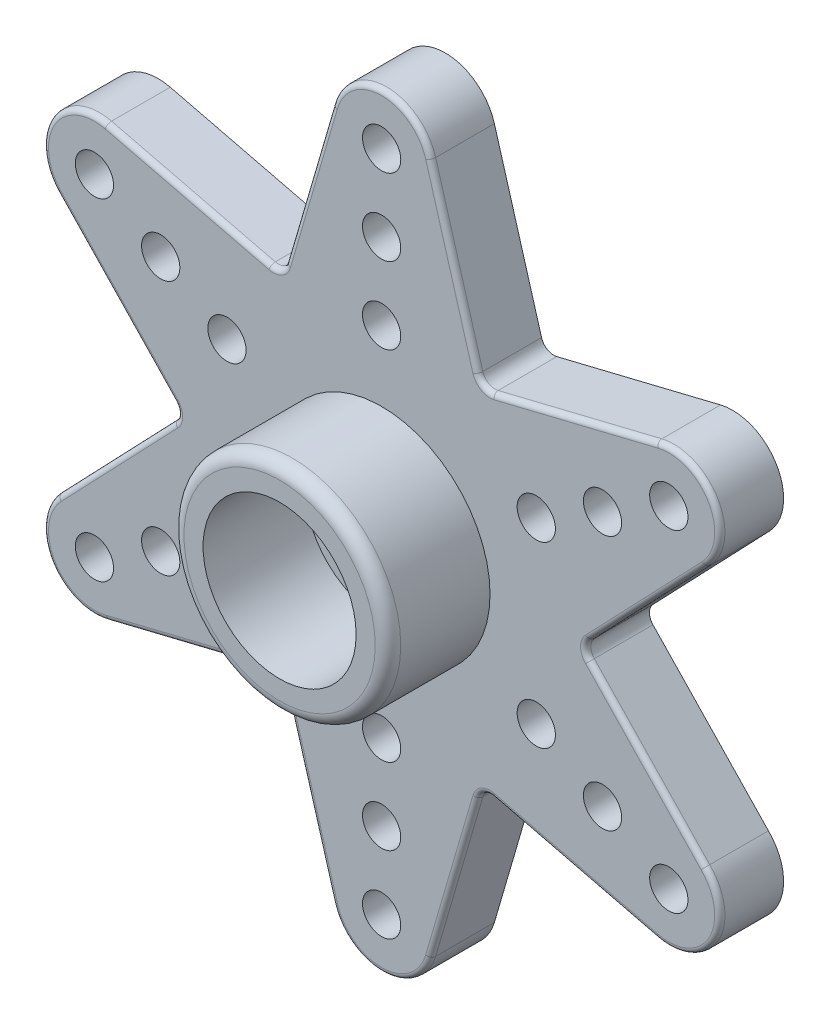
ISO-10303-21;
HEADER;
FILE_DESCRIPTION(('STEP AP214'),'2;1');
FILE_NAME('part.step','',(''),(''),'','','');
FILE_SCHEMA(('AUTOMOTIVE_DESIGN { 1 0 10303 214 1 1 1 1 }'));
ENDSEC;
DATA;
#1=APPLICATION_CONTEXT('core data for automotive mechanical design processes');
#2=APPLICATION_PROTOCOL_DEFINITION('international standard','automotive_design',2000,#1);
#3=PRODUCT_CONTEXT('',#1,'mechanical');
#4=PRODUCT('Part','Part','',(#3));
#5=PRODUCT_RELATED_PRODUCT_CATEGORY('part','',(#4));
#6=PRODUCT_DEFINITION_FORMATION('','',#4);
#7=PRODUCT_DEFINITION_CONTEXT('part definition',#1,'design');
#8=PRODUCT_DEFINITION('design','',#6,#7);
#9=PRODUCT_DEFINITION_SHAPE('','',#8);
#10=(LENGTH_UNIT() NAMED_UNIT(*) SI_UNIT(.MILLI.,.METRE.));
#11=(NAMED_UNIT(*) PLANE_ANGLE_UNIT() SI_UNIT($,.RADIAN.));
#12=(NAMED_UNIT(*) SI_UNIT($,.STERADIAN.) SOLID_ANGLE_UNIT());
#13=UNCERTAINTY_MEASURE_WITH_UNIT(LENGTH_MEASURE(1.E-05),#10,'distance_accuracy_value','');
#14=(GEOMETRIC_REPRESENTATION_CONTEXT(3) GLOBAL_UNCERTAINTY_ASSIGNED_CONTEXT((#13)) GLOBAL_UNIT_ASSIGNED_CONTEXT((#10,
#11,#12)) REPRESENTATION_CONTEXT('',''));
#15=CARTESIAN_POINT('',(0.,0.,0.));
#16=DIRECTION('',(0.,0.,1.));
#17=DIRECTION('',(1.,0.,0.));
#18=AXIS2_PLACEMENT_3D('',#15,#16,#17);
#19=CARTESIAN_POINT('',(0.,0.,0.8));
#20=DIRECTION('',(0.,0.,-1.));
#21=DIRECTION('',(-1.,0.,0.));
#22=AXIS2_PLACEMENT_3D('',#19,#20,#21);
#23=PLANE('',#22);
#24=CARTESIAN_POINT('',(0.,0.,0.8));
#25=DIRECTION('',(0.,0.,-1.));
#26=DIRECTION('',(-1.,0.,0.));
#27=AXIS2_PLACEMENT_3D('',#24,#25,#26);
#28=CIRCLE('',#27,4.5);
#29=CARTESIAN_POINT('',(-4.49999999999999,0.,0.8));
#30=VERTEX_POINT('',#29);
#31=EDGE_CURVE('E416',#30,#30,#28,.T.);
#32=ORIENTED_EDGE('',*,*,#31,.T.);
#33=EDGE_LOOP('',(#32));
#34=FACE_BOUND('',#33,.T.);
#35=CARTESIAN_POINT('',(0.,0.,0.8));
#36=DIRECTION('',(0.,0.,-1.));
#37=DIRECTION('',(-1.,0.,0.));
#38=AXIS2_PLACEMENT_3D('',#35,#36,#37);
#39=CIRCLE('',#38,3.7);
#40=CARTESIAN_POINT('',(-3.7,0.,0.8));
#41=VERTEX_POINT('',#40);
#42=EDGE_CURVE('E691',#41,#41,#39,.T.);
#43=ORIENTED_EDGE('',*,*,#42,.F.);
#44=EDGE_LOOP('',(#43));
#45=FACE_BOUND('',#44,.T.);
#46=ADVANCED_FACE('F33',(#34,#45),#23,.T.);
#47=CARTESIAN_POINT('',(0.,0.,2.5));
#48=DIRECTION('',(0.,0.,-1.));
#49=DIRECTION('',(-1.,0.,0.));
#50=AXIS2_PLACEMENT_3D('',#47,#48,#49);
#51=CYLINDRICAL_SURFACE('',#50,1.5);
#52=CARTESIAN_POINT('',(0.,0.,2.5));
#53=DIRECTION('',(0.,0.,1.));
#54=DIRECTION('',(1.,0.,0.));
#55=AXIS2_PLACEMENT_3D('',#52,#53,#54);
#56=CIRCLE('',#55,1.5);
#57=CARTESIAN_POINT('',(1.50000000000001,0.,2.5));
#58=VERTEX_POINT('',#57);
#59=EDGE_CURVE('E737',#58,#58,#56,.T.);
#60=ORIENTED_EDGE('',*,*,#59,.T.);
#61=EDGE_LOOP('',(#60));
#62=FACE_BOUND('',#61,.T.);
#63=CARTESIAN_POINT('',(0.,0.,0.8));
#64=DIRECTION('',(0.,0.,-1.));
#65=DIRECTION('',(-1.,0.,0.));
#66=AXIS2_PLACEMENT_3D('',#63,#64,#65);
#67=CIRCLE('',#66,1.5);
#68=CARTESIAN_POINT('',(-1.49999999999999,0.,0.8));
#69=VERTEX_POINT('',#68);
#70=EDGE_CURVE('E412',#69,#69,#67,.T.);
#71=ORIENTED_EDGE('',*,*,#70,.T.);
#72=EDGE_LOOP('',(#71));
#73=FACE_BOUND('',#72,.T.);
#74=ADVANCED_FACE('F644',(#62,#73),#51,.F.);
#75=CARTESIAN_POINT('',(-8.499464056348,7.88570556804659E-05,2.5));
#76=DIRECTION('',(0.,0.,1.));
#77=DIRECTION('',(1.,0.,0.));
#78=AXIS2_PLACEMENT_3D('',#75,#76,#77);
#79=PLANE('',#78);
#80=DIRECTION('',(-0.280191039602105,-0.95994425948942,0.));
#81=VECTOR('',#80,1.);
#82=CARTESIAN_POINT('',(-3.57755354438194,7.16450878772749,2.5));
#83=LINE('',#82,#81);
#84=CARTESIAN_POINT('',(-1.74216967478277,13.4525978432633,2.5));
#85=VERTEX_POINT('',#84);
#86=CARTESIAN_POINT('',(-3.57755354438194,7.16450878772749,2.5));
#87=VERTEX_POINT('',#86);
#88=EDGE_CURVE('E470',#85,#87,#83,.T.);
#89=ORIENTED_EDGE('',*,*,#88,.T.);
#90=CARTESIAN_POINT('',(-4.24951452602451,7.36064251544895,2.5));
#91=DIRECTION('',(0.,0.,1.));
#92=DIRECTION('',(1.,0.,0.));
#93=AXIS2_PLACEMENT_3D('',#90,#91,#92);
#94=CIRCLE('',#93,0.699999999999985);
#95=CARTESIAN_POINT('',(-4.41570145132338,6.68065582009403,2.5));
#96=VERTEX_POINT('',#95);
#97=EDGE_CURVE('E472',#87,#96,#94,.F.);
#98=ORIENTED_EDGE('',*,*,#97,.T.);
#99=DIRECTION('',(-0.97140956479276,0.237409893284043,0.));
#100=VECTOR('',#99,1.);
#101=CARTESIAN_POINT('',(-10.8333169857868,8.24910385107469,2.5));
#102=LINE('',#101,#100);
#103=CARTESIAN_POINT('',(-10.8330845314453,8.24904718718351,2.5));
#104=VERTEX_POINT('',#103);
#105=EDGE_CURVE('E466',#96,#104,#102,.T.);
#106=ORIENTED_EDGE('',*,*,#105,.T.);
#107=CARTESIAN_POINT('',(-11.2583302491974,6.5000000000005,2.5));
#108=DIRECTION('',(0.,0.,1.));
#109=DIRECTION('',(1.,0.,0.));
#110=AXIS2_PLACEMENT_3D('',#107,#108,#109);
#111=CIRCLE('',#110,1.79999999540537);
#112=CARTESIAN_POINT('',(-12.5604265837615,5.25720291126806,2.5));
#113=VERTEX_POINT('',#112);
#114=EDGE_CURVE('E460',#104,#113,#111,.T.);
#115=ORIENTED_EDGE('',*,*,#114,.T.);
#116=DIRECTION('',(0.69130778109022,-0.722560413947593,0.));
#117=VECTOR('',#116,1.);
#118=CARTESIAN_POINT('',(-7.99367176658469,0.483994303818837,2.5));
#119=LINE('',#118,#117);
#120=CARTESIAN_POINT('',(-7.99367176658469,0.483994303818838,2.5));
#121=VERTEX_POINT('',#120);
#122=EDGE_CURVE('E456',#113,#121,#119,.T.);
#123=ORIENTED_EDGE('',*,*,#122,.T.);
#124=CARTESIAN_POINT('',(-8.499464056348,7.88570556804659E-05,2.5));
#125=DIRECTION('',(0.,0.,1.));
#126=DIRECTION('',(1.,0.,0.));
#127=AXIS2_PLACEMENT_3D('',#124,#125,#126);
#128=CIRCLE('',#127,0.7);
#129=CARTESIAN_POINT('',(-7.99366388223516,-0.483828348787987,2.5));
#130=VERTEX_POINT('',#129);
#131=EDGE_CURVE('E454',#121,#130,#128,.F.);
#132=ORIENTED_EDGE('',*,*,#131,.T.);
#133=DIRECTION('',(-0.691296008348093,-0.722571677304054,0.));
#134=VECTOR('',#133,1.);
#135=CARTESIAN_POINT('',(-12.5589592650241,-5.25566718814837,2.5));
#136=LINE('',#135,#134);
#137=CARTESIAN_POINT('',(-12.5589592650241,-5.25566718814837,2.5));
#138=VERTEX_POINT('',#137);
#139=EDGE_CURVE('E448',#130,#138,#136,.T.);
#140=ORIENTED_EDGE('',*,*,#139,.T.);
#141=CARTESIAN_POINT('',(-11.2583302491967,-6.49999999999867,2.5));
#142=DIRECTION('',(0.,0.,1.));
#143=DIRECTION('',(1.,0.,0.));
#144=AXIS2_PLACEMENT_3D('',#141,#142,#143);
#145=CIRCLE('',#144,1.79999999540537);
#146=CARTESIAN_POINT('',(-10.7792066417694,-8.23506211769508,2.5));
#147=VERTEX_POINT('',#146);
#148=EDGE_CURVE('E443',#138,#147,#145,.T.);
#149=ORIENTED_EDGE('',*,*,#148,.T.);
#150=DIRECTION('',(0.971431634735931,0.237319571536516,0.));
#151=VECTOR('',#150,1.);
#152=CARTESIAN_POINT('',(-4.41586984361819,-6.68050664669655,2.5));
#153=LINE('',#152,#151);
#154=CARTESIAN_POINT('',(-4.41586984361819,-6.68050664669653,2.5));
#155=VERTEX_POINT('',#154);
#156=EDGE_CURVE('E439',#147,#155,#153,.T.);
#157=ORIENTED_EDGE('',*,*,#156,.T.);
#158=CARTESIAN_POINT('',(-4.24974614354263,-7.36050879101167,2.5));
#159=DIRECTION('',(0.,0.,1.));
#160=DIRECTION('',(1.,0.,0.));
#161=AXIS2_PLACEMENT_3D('',#158,#159,#160);
#162=CIRCLE('',#161,0.699999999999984);
#163=CARTESIAN_POINT('',(-3.57776692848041,-7.16443754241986,2.5));
#164=VERTEX_POINT('',#163);
#165=EDGE_CURVE('E437',#155,#164,#162,.F.);
#166=ORIENTED_EDGE('',*,*,#165,.T.);
#167=DIRECTION('',(0.280101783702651,-0.959970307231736,0.));
#168=VECTOR('',#167,1.);
#169=CARTESIAN_POINT('',(-1.72727500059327,-13.5064796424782,2.5));
#170=LINE('',#169,#168);
#171=CARTESIAN_POINT('',(-1.72734215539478,-13.5062499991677,2.5));
#172=VERTEX_POINT('',#171);
#173=EDGE_CURVE('E431',#164,#172,#170,.T.);
#174=ORIENTED_EDGE('',*,*,#173,.T.);
#175=CARTESIAN_POINT('',(-5.16057624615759E-13,-13.,2.5));
#176=DIRECTION('',(0.,0.,1.));
#177=DIRECTION('',(1.,0.,0.));
#178=AXIS2_PLACEMENT_3D('',#175,#176,#177);
#179=CIRCLE('',#178,1.79999999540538);
#180=CARTESIAN_POINT('',(1.72734201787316,-13.5062499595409,2.5));
#181=VERTEX_POINT('',#180);
#182=EDGE_CURVE('E427',#172,#181,#179,.T.);
#183=ORIENTED_EDGE('',*,*,#182,.T.);
#184=DIRECTION('',(0.280101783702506,0.959970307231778,0.));
#185=VECTOR('',#184,1.);
#186=CARTESIAN_POINT('',(3.57768452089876,-7.16471997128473,2.5));
#187=LINE('',#186,#185);
#188=CARTESIAN_POINT('',(3.57768452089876,-7.16471997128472,2.5));
#189=VERTEX_POINT('',#188);
#190=EDGE_CURVE('E425',#181,#189,#187,.T.);
#191=ORIENTED_EDGE('',*,*,#190,.T.);
#192=CARTESIAN_POINT('',(4.24966373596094,-7.36079121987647,2.5));
#193=DIRECTION('',(0.,0.,1.));
#194=DIRECTION('',(1.,0.,0.));
#195=AXIS2_PLACEMENT_3D('',#192,#193,#194);
#196=CIRCLE('',#195,0.699999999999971);
#197=CARTESIAN_POINT('',(4.41583958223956,-6.68080181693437,2.5));
#198=VERTEX_POINT('',#197);
#199=EDGE_CURVE('E429',#189,#198,#196,.F.);
#200=ORIENTED_EDGE('',*,*,#199,.T.);
#201=DIRECTION('',(0.971413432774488,-0.237394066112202,0.));
#202=VECTOR('',#201,1.);
#203=CARTESIAN_POINT('',(10.8310209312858,-8.24854417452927,2.5));
#204=LINE('',#203,#202);
#205=CARTESIAN_POINT('',(10.8310209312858,-8.24854417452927,2.5));
#206=VERTEX_POINT('',#205);
#207=EDGE_CURVE('E433',#198,#206,#204,.T.);
#208=ORIENTED_EDGE('',*,*,#207,.T.);
#209=CARTESIAN_POINT('',(11.258330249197,-6.49999999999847,2.5));
#210=DIRECTION('',(0.,0.,1.));
#211=DIRECTION('',(1.,0.,0.));
#212=AXIS2_PLACEMENT_3D('',#209,#210,#211);
#213=CIRCLE('',#212,1.79999999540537);
#214=CARTESIAN_POINT('',(12.5213763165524,-5.2175357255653,2.5));
#215=VERTEX_POINT('',#214);
#216=EDGE_CURVE('E435',#206,#215,#213,.T.);
#217=ORIENTED_EDGE('',*,*,#216,.T.);
#218=DIRECTION('',(-0.691240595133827,0.722624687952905,0.));
#219=VECTOR('',#218,1.);
#220=CARTESIAN_POINT('',(7.99342338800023,-0.484002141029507,2.5));
#221=LINE('',#220,#219);
#222=CARTESIAN_POINT('',(7.99342338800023,-0.484002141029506,2.5));
#223=VERTEX_POINT('',#222);
#224=EDGE_CURVE('E441',#215,#223,#221,.T.);
#225=ORIENTED_EDGE('',*,*,#224,.T.);
#226=CARTESIAN_POINT('',(8.49926066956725,-0.000133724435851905,2.5));
#227=DIRECTION('',(0.,0.,1.));
#228=DIRECTION('',(1.,0.,0.));
#229=AXIS2_PLACEMENT_3D('',#226,#227,#228);
#230=CIRCLE('',#229,0.699999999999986);
#231=CARTESIAN_POINT('',(7.9934683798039,0.483781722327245,2.5));
#232=VERTEX_POINT('',#231);
#233=EDGE_CURVE('E445',#223,#232,#230,.F.);
#234=ORIENTED_EDGE('',*,*,#233,.T.);
#235=DIRECTION('',(0.69130778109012,0.722560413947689,0.));
#236=VECTOR('',#235,1.);
#237=CARTESIAN_POINT('',(12.5605919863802,5.25737579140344,2.5));
#238=LINE('',#237,#236);
#239=CARTESIAN_POINT('',(12.5604265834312,5.25720291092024,2.5));
#240=VERTEX_POINT('',#239);
#241=EDGE_CURVE('E450',#232,#240,#238,.T.);
#242=ORIENTED_EDGE('',*,*,#241,.T.);
#243=CARTESIAN_POINT('',(11.258330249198,6.49999999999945,2.5));
#244=DIRECTION('',(0.,0.,1.));
#245=DIRECTION('',(1.,0.,0.));
#246=AXIS2_PLACEMENT_3D('',#243,#244,#245);
#247=CIRCLE('',#246,1.79999999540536);
#248=CARTESIAN_POINT('',(10.8330845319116,8.24904718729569,2.5));
#249=VERTEX_POINT('',#248);
#250=EDGE_CURVE('E452',#240,#249,#247,.T.);
#251=ORIENTED_EDGE('',*,*,#250,.T.);
#252=DIRECTION('',(-0.971409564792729,-0.237409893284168,0.));
#253=VECTOR('',#252,1.);
#254=CARTESIAN_POINT('',(4.4159872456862,6.68072566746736,2.5));
#255=LINE('',#254,#253);
#256=CARTESIAN_POINT('',(4.4159872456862,6.68072566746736,2.5));
#257=VERTEX_POINT('',#256);
#258=EDGE_CURVE('E458',#249,#257,#255,.T.);
#259=ORIENTED_EDGE('',*,*,#258,.T.);
#260=CARTESIAN_POINT('',(4.24980032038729,7.3607123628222,2.5));
#261=DIRECTION('',(0.,0.,1.));
#262=DIRECTION('',(1.,0.,0.));
#263=AXIS2_PLACEMENT_3D('',#260,#261,#262);
#264=CIRCLE('',#263,0.699999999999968);
#265=CARTESIAN_POINT('',(3.57782429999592,7.1646301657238,2.5));
#266=VERTEX_POINT('',#265);
#267=EDGE_CURVE('E462',#257,#266,#264,.F.);
#268=ORIENTED_EDGE('',*,*,#267,.T.);
#269=DIRECTION('',(-0.280117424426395,0.959965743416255,0.));
#270=VECTOR('',#269,1.);
#271=CARTESIAN_POINT('',(1.72793833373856,13.5042113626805,2.5));
#272=LINE('',#271,#270);
#273=CARTESIAN_POINT('',(1.72793833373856,13.5042113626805,2.5));
#274=VERTEX_POINT('',#273);
#275=EDGE_CURVE('E464',#266,#274,#272,.T.);
#276=ORIENTED_EDGE('',*,*,#275,.T.);
#277=CARTESIAN_POINT('',(0.,13.,2.5));
#278=DIRECTION('',(0.,0.,1.));
#279=DIRECTION('',(1.,0.,0.));
#280=AXIS2_PLACEMENT_3D('',#277,#278,#279);
#281=CIRCLE('',#280,1.79999999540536);
#282=EDGE_CURVE('E468',#274,#85,#281,.T.);
#283=ORIENTED_EDGE('',*,*,#282,.T.);
#284=EDGE_LOOP('',(#89,#98,#106,#115,#123,#132,#140,#149,#157,#166,#174,#183,#191,#200,#208,
#217,#225,#234,#242,#251,#259,#268,#276,#283));
#285=FACE_BOUND('',#284,.T.);
#286=CARTESIAN_POINT('',(2.59917745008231E-12,-10.,2.5));
#287=DIRECTION('',(0.,0.,1.));
#288=DIRECTION('',(1.,0.,0.));
#289=AXIS2_PLACEMENT_3D('',#286,#287,#288);
#290=CIRCLE('',#289,0.750000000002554);
#291=CARTESIAN_POINT('',(0.750000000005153,-10.,2.5));
#292=VERTEX_POINT('',#291);
#293=EDGE_CURVE('E716',#292,#292,#290,.T.);
#294=ORIENTED_EDGE('',*,*,#293,.F.);
#295=EDGE_LOOP('',(#294));
#296=FACE_BOUND('',#295,.T.);
#297=CARTESIAN_POINT('',(11.2583302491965,6.50000000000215,2.5));
#298=DIRECTION('',(0.,0.,1.));
#299=DIRECTION('',(1.,0.,0.));
#300=AXIS2_PLACEMENT_3D('',#297,#298,#299);
#301=CIRCLE('',#300,0.750000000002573);
#302=CARTESIAN_POINT('',(12.008330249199,6.50000000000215,2.5));
#303=VERTEX_POINT('',#302);
#304=EDGE_CURVE('E728',#303,#303,#301,.T.);
#305=ORIENTED_EDGE('',*,*,#304,.F.);
#306=EDGE_LOOP('',(#305));
#307=FACE_BOUND('',#306,.T.);
#308=CARTESIAN_POINT('',(0.,13.,2.5));
#309=DIRECTION('',(0.,0.,1.));
#310=DIRECTION('',(1.,0.,0.));
#311=AXIS2_PLACEMENT_3D('',#308,#309,#310);
#312=CIRCLE('',#311,0.750000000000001);
#313=CARTESIAN_POINT('',(0.750000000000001,13.,2.5));
#314=VERTEX_POINT('',#313);
#315=EDGE_CURVE('E749',#314,#314,#312,.T.);
#316=ORIENTED_EDGE('',*,*,#315,.F.);
#317=EDGE_LOOP('',(#316));
#318=FACE_BOUND('',#317,.T.);
#319=CARTESIAN_POINT('',(0.,7.,2.5));
#320=DIRECTION('',(0.,0.,1.));
#321=DIRECTION('',(1.,0.,0.));
#322=AXIS2_PLACEMENT_3D('',#319,#320,#321);
#323=CIRCLE('',#322,0.75);
#324=CARTESIAN_POINT('',(0.750000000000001,7.,2.5));
#325=VERTEX_POINT('',#324);
#326=EDGE_CURVE('E761',#325,#325,#323,.T.);
#327=ORIENTED_EDGE('',*,*,#326,.F.);
#328=EDGE_LOOP('',(#327));
#329=FACE_BOUND('',#328,.T.);
#330=CARTESIAN_POINT('',(-8.66025403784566,4.99999999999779,2.5));
#331=DIRECTION('',(0.,0.,1.));
#332=DIRECTION('',(1.,0.,0.));
#333=AXIS2_PLACEMENT_3D('',#330,#331,#332);
#334=CIRCLE('',#333,0.750000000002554);
#335=CARTESIAN_POINT('',(-7.91025403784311,4.99999999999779,2.5));
#336=VERTEX_POINT('',#335);
#337=EDGE_CURVE('E773',#336,#336,#334,.T.);
#338=ORIENTED_EDGE('',*,*,#337,.F.);
#339=EDGE_LOOP('',(#338));
#340=FACE_BOUND('',#339,.T.);
#341=CARTESIAN_POINT('',(-11.2583302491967,-6.49999999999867,2.5));
#342=DIRECTION('',(0.,0.,1.));
#343=DIRECTION('',(1.,0.,0.));
#344=AXIS2_PLACEMENT_3D('',#341,#342,#343);
#345=CIRCLE('',#344,0.74999999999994);
#346=CARTESIAN_POINT('',(-10.5083302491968,-6.49999999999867,2.5));
#347=VERTEX_POINT('',#346);
#348=EDGE_CURVE('E785',#347,#347,#345,.T.);
#349=ORIENTED_EDGE('',*,*,#348,.F.);
#350=EDGE_LOOP('',(#349));
#351=FACE_BOUND('',#350,.T.);
#352=CARTESIAN_POINT('',(-6.06217782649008,-3.49999999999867,2.5));
#353=DIRECTION('',(0.,0.,1.));
#354=DIRECTION('',(1.,0.,0.));
#355=AXIS2_PLACEMENT_3D('',#352,#353,#354);
#356=CIRCLE('',#355,0.749999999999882);
#357=CARTESIAN_POINT('',(-5.3121778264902,-3.49999999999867,2.5));
#358=VERTEX_POINT('',#357);
#359=EDGE_CURVE('E797',#358,#358,#356,.T.);
#360=ORIENTED_EDGE('',*,*,#359,.F.);
#361=EDGE_LOOP('',(#360));
#362=FACE_BOUND('',#361,.T.);
#363=CARTESIAN_POINT('',(8.66025403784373,-4.99999999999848,2.5));
#364=DIRECTION('',(0.,0.,1.));
#365=DIRECTION('',(1.,0.,0.));
#366=AXIS2_PLACEMENT_3D('',#363,#364,#365);
#367=CIRCLE('',#366,0.750000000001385);
#368=CARTESIAN_POINT('',(9.41025403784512,-4.99999999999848,2.5));
#369=VERTEX_POINT('',#368);
#370=EDGE_CURVE('E809',#369,#369,#367,.T.);
#371=ORIENTED_EDGE('',*,*,#370,.F.);
#372=EDGE_LOOP('',(#371));
#373=FACE_BOUND('',#372,.T.);
#374=CARTESIAN_POINT('',(6.06217782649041,-3.49999999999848,2.5));
#375=DIRECTION('',(0.,0.,1.));
#376=DIRECTION('',(1.,0.,0.));
#377=AXIS2_PLACEMENT_3D('',#374,#375,#376);
#378=CIRCLE('',#377,0.75000000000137);
#379=CARTESIAN_POINT('',(6.81217782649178,-3.49999999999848,2.5));
#380=VERTEX_POINT('',#379);
#381=EDGE_CURVE('E295',#380,#380,#378,.T.);
#382=ORIENTED_EDGE('',*,*,#381,.F.);
#383=EDGE_LOOP('',(#382));
#384=FACE_BOUND('',#383,.T.);
#385=CARTESIAN_POINT('',(11.258330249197,-6.49999999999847,2.5));
#386=DIRECTION('',(0.,0.,1.));
#387=DIRECTION('',(1.,0.,0.));
#388=AXIS2_PLACEMENT_3D('',#385,#386,#387);
#389=CIRCLE('',#388,0.750000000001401);
#390=CARTESIAN_POINT('',(12.0083302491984,-6.49999999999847,2.5));
#391=VERTEX_POINT('',#390);
#392=EDGE_CURVE('E803',#391,#391,#389,.T.);
#393=ORIENTED_EDGE('',*,*,#392,.F.);
#394=EDGE_LOOP('',(#393));
#395=FACE_BOUND('',#394,.T.);
#396=CARTESIAN_POINT('',(-8.6602540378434,-4.99999999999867,2.5));
#397=DIRECTION('',(0.,0.,1.));
#398=DIRECTION('',(1.,0.,0.));
#399=AXIS2_PLACEMENT_3D('',#396,#397,#398);
#400=CIRCLE('',#399,0.749999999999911);
#401=CARTESIAN_POINT('',(-7.91025403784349,-4.99999999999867,2.5));
#402=VERTEX_POINT('',#401);
#403=EDGE_CURVE('E791',#402,#402,#400,.T.);
#404=ORIENTED_EDGE('',*,*,#403,.F.);
#405=EDGE_LOOP('',(#404));
#406=FACE_BOUND('',#405,.T.);
#407=CARTESIAN_POINT('',(-6.06217782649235,3.49999999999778,2.5));
#408=DIRECTION('',(0.,0.,1.));
#409=DIRECTION('',(1.,0.,0.));
#410=AXIS2_PLACEMENT_3D('',#407,#408,#409);
#411=CIRCLE('',#410,0.750000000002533);
#412=CARTESIAN_POINT('',(-5.31217782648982,3.49999999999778,2.5));
#413=VERTEX_POINT('',#412);
#414=EDGE_CURVE('E779',#413,#413,#411,.T.);
#415=ORIENTED_EDGE('',*,*,#414,.F.);
#416=EDGE_LOOP('',(#415));
#417=FACE_BOUND('',#416,.T.);
#418=CARTESIAN_POINT('',(-11.258330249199,6.4999999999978,2.5));
#419=DIRECTION('',(0.,0.,1.));
#420=DIRECTION('',(1.,0.,0.));
#421=AXIS2_PLACEMENT_3D('',#418,#419,#420);
#422=CIRCLE('',#421,0.750000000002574);
#423=CARTESIAN_POINT('',(-10.5083302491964,6.4999999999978,2.5));
#424=VERTEX_POINT('',#423);
#425=EDGE_CURVE('E767',#424,#424,#422,.T.);
#426=ORIENTED_EDGE('',*,*,#425,.F.);
#427=EDGE_LOOP('',(#426));
#428=FACE_BOUND('',#427,.T.);
#429=CARTESIAN_POINT('',(0.,10.,2.5));
#430=DIRECTION('',(0.,0.,1.));
#431=DIRECTION('',(1.,0.,0.));
#432=AXIS2_PLACEMENT_3D('',#429,#430,#431);
#433=CIRCLE('',#432,0.750000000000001);
#434=CARTESIAN_POINT('',(0.750000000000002,10.,2.5));
#435=VERTEX_POINT('',#434);
#436=EDGE_CURVE('E755',#435,#435,#433,.T.);
#437=ORIENTED_EDGE('',*,*,#436,.F.);
#438=EDGE_LOOP('',(#437));
#439=FACE_BOUND('',#438,.T.);
#440=CARTESIAN_POINT('',(6.0621778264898,3.50000000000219,2.5));
#441=DIRECTION('',(0.,0.,1.));
#442=DIRECTION('',(1.,0.,0.));
#443=AXIS2_PLACEMENT_3D('',#440,#441,#442);
#444=CIRCLE('',#443,0.750000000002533);
#445=CARTESIAN_POINT('',(6.81217782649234,3.50000000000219,2.5));
#446=VERTEX_POINT('',#445);
#447=EDGE_CURVE('E743',#446,#446,#444,.T.);
#448=ORIENTED_EDGE('',*,*,#447,.F.);
#449=EDGE_LOOP('',(#448));
#450=FACE_BOUND('',#449,.T.);
#451=CARTESIAN_POINT('',(8.66025403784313,5.00000000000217,2.5));
#452=DIRECTION('',(0.,0.,1.));
#453=DIRECTION('',(1.,0.,0.));
#454=AXIS2_PLACEMENT_3D('',#451,#452,#453);
#455=CIRCLE('',#454,0.750000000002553);
#456=CARTESIAN_POINT('',(9.41025403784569,5.00000000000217,2.5));
#457=VERTEX_POINT('',#456);
#458=EDGE_CURVE('E734',#457,#457,#455,.T.);
#459=ORIENTED_EDGE('',*,*,#458,.F.);
#460=EDGE_LOOP('',(#459));
#461=FACE_BOUND('',#460,.T.);
#462=CARTESIAN_POINT('',(2.59844266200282E-12,-7.,2.5));
#463=DIRECTION('',(0.,0.,1.));
#464=DIRECTION('',(1.,0.,0.));
#465=AXIS2_PLACEMENT_3D('',#462,#463,#464);
#466=CIRCLE('',#465,0.750000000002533);
#467=CARTESIAN_POINT('',(0.750000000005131,-7.,2.5));
#468=VERTEX_POINT('',#467);
#469=EDGE_CURVE('E722',#468,#468,#466,.T.);
#470=ORIENTED_EDGE('',*,*,#469,.F.);
#471=EDGE_LOOP('',(#470));
#472=FACE_BOUND('',#471,.T.);
#473=CARTESIAN_POINT('',(2.5999122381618E-12,-13.,2.5));
#474=DIRECTION('',(0.,0.,1.));
#475=DIRECTION('',(1.,0.,0.));
#476=AXIS2_PLACEMENT_3D('',#473,#474,#475);
#477=CIRCLE('',#476,0.750000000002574);
#478=CARTESIAN_POINT('',(0.750000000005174,-13.,2.5));
#479=VERTEX_POINT('',#478);
#480=EDGE_CURVE('E710',#479,#479,#477,.T.);
#481=ORIENTED_EDGE('',*,*,#480,.F.);
#482=EDGE_LOOP('',(#481));
#483=FACE_BOUND('',#482,.T.);
#484=CARTESIAN_POINT('',(0.,0.,2.5));
#485=DIRECTION('',(0.,0.,1.));
#486=DIRECTION('',(1.,0.,0.));
#487=AXIS2_PLACEMENT_3D('',#484,#485,#486);
#488=CIRCLE('',#487,4.25);
#489=CARTESIAN_POINT('',(4.25,0.,2.5));
#490=VERTEX_POINT('',#489);
#491=EDGE_CURVE('E706',#490,#490,#488,.T.);
#492=ORIENTED_EDGE('',*,*,#491,.F.);
#493=EDGE_LOOP('',(#492));
#494=FACE_BOUND('',#493,.T.);
#495=ADVANCED_FACE('F651',(#285,#296,#307,#318,#329,#340,#351,#362,#373,#384,#395,#406,#417,
#428,#439,#450,#461,#472,#483,#494),#79,.T.);
#496=CARTESIAN_POINT('',(0.,0.,2.5));
#497=DIRECTION('',(0.,0.,1.));
#498=DIRECTION('',(1.,0.,0.));
#499=AXIS2_PLACEMENT_3D('',#496,#497,#498);
#500=CIRCLE('',#499,3.);
#501=CARTESIAN_POINT('',(3.,0.,2.5));
#502=VERTEX_POINT('',#501);
#503=EDGE_CURVE('E278',#502,#502,#500,.F.);
#504=ORIENTED_EDGE('',*,*,#503,.F.);
#505=EDGE_LOOP('',(#504));
#506=FACE_BOUND('',#505,.T.);
#507=ORIENTED_EDGE('',*,*,#59,.F.);
#508=EDGE_LOOP('',(#507));
#509=FACE_BOUND('',#508,.T.);
#510=ADVANCED_FACE('F834',(#506,#509),#79,.T.);
#511=CARTESIAN_POINT('',(-8.499464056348,7.88570556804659E-05,0.));
#512=DIRECTION('',(0.,0.,1.));
#513=DIRECTION('',(1.,0.,0.));
#514=AXIS2_PLACEMENT_3D('',#511,#512,#513);
#515=PLANE('',#514);
#516=CARTESIAN_POINT('',(0.,0.,0.));
#517=DIRECTION('',(0.,0.,-1.));
#518=DIRECTION('',(-1.,0.,0.));
#519=AXIS2_PLACEMENT_3D('',#516,#517,#518);
#520=CIRCLE('',#519,4.5);
#521=CARTESIAN_POINT('',(-4.49999999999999,0.,0.));
#522=VERTEX_POINT('',#521);
#523=EDGE_CURVE('E699',#522,#522,#520,.T.);
#524=ORIENTED_EDGE('',*,*,#523,.F.);
#525=EDGE_LOOP('',(#524));
#526=FACE_BOUND('',#525,.T.);
#527=CARTESIAN_POINT('',(2.59917745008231E-12,-10.,0.));
#528=DIRECTION('',(0.,0.,1.));
#529=DIRECTION('',(1.,0.,0.));
#530=AXIS2_PLACEMENT_3D('',#527,#528,#529);
#531=CIRCLE('',#530,0.750000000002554);
#532=CARTESIAN_POINT('',(0.750000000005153,-10.,0.));
#533=VERTEX_POINT('',#532);
#534=EDGE_CURVE('E713',#533,#533,#531,.T.);
#535=ORIENTED_EDGE('',*,*,#534,.T.);
#536=EDGE_LOOP('',(#535));
#537=FACE_BOUND('',#536,.T.);
#538=CARTESIAN_POINT('',(11.2583302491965,6.50000000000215,0.));
#539=DIRECTION('',(0.,0.,1.));
#540=DIRECTION('',(1.,0.,0.));
#541=AXIS2_PLACEMENT_3D('',#538,#539,#540);
#542=CIRCLE('',#541,0.750000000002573);
#543=CARTESIAN_POINT('',(12.008330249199,6.50000000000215,0.));
#544=VERTEX_POINT('',#543);
#545=EDGE_CURVE('E725',#544,#544,#542,.T.);
#546=ORIENTED_EDGE('',*,*,#545,.T.);
#547=EDGE_LOOP('',(#546));
#548=FACE_BOUND('',#547,.T.);
#549=CARTESIAN_POINT('',(0.,13.,0.));
#550=DIRECTION('',(0.,0.,1.));
#551=DIRECTION('',(1.,0.,0.));
#552=AXIS2_PLACEMENT_3D('',#549,#550,#551);
#553=CIRCLE('',#552,0.750000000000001);
#554=CARTESIAN_POINT('',(0.750000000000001,13.,0.));
#555=VERTEX_POINT('',#554);
#556=EDGE_CURVE('E746',#555,#555,#553,.T.);
#557=ORIENTED_EDGE('',*,*,#556,.T.);
#558=EDGE_LOOP('',(#557));
#559=FACE_BOUND('',#558,.T.);
#560=CARTESIAN_POINT('',(0.,7.,0.));
#561=DIRECTION('',(0.,0.,1.));
#562=DIRECTION('',(1.,0.,0.));
#563=AXIS2_PLACEMENT_3D('',#560,#561,#562);
#564=CIRCLE('',#563,0.75);
#565=CARTESIAN_POINT('',(0.750000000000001,7.,0.));
#566=VERTEX_POINT('',#565);
#567=EDGE_CURVE('E758',#566,#566,#564,.T.);
#568=ORIENTED_EDGE('',*,*,#567,.T.);
#569=EDGE_LOOP('',(#568));
#570=FACE_BOUND('',#569,.T.);
#571=CARTESIAN_POINT('',(-8.66025403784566,4.99999999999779,0.));
#572=DIRECTION('',(0.,0.,1.));
#573=DIRECTION('',(1.,0.,0.));
#574=AXIS2_PLACEMENT_3D('',#571,#572,#573);
#575=CIRCLE('',#574,0.750000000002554);
#576=CARTESIAN_POINT('',(-7.91025403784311,4.99999999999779,0.));
#577=VERTEX_POINT('',#576);
#578=EDGE_CURVE('E770',#577,#577,#575,.T.);
#579=ORIENTED_EDGE('',*,*,#578,.T.);
#580=EDGE_LOOP('',(#579));
#581=FACE_BOUND('',#580,.T.);
#582=CARTESIAN_POINT('',(-11.2583302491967,-6.49999999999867,0.));
#583=DIRECTION('',(0.,0.,1.));
#584=DIRECTION('',(1.,0.,0.));
#585=AXIS2_PLACEMENT_3D('',#582,#583,#584);
#586=CIRCLE('',#585,0.74999999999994);
#587=CARTESIAN_POINT('',(-10.5083302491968,-6.49999999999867,0.));
#588=VERTEX_POINT('',#587);
#589=EDGE_CURVE('E782',#588,#588,#586,.T.);
#590=ORIENTED_EDGE('',*,*,#589,.T.);
#591=EDGE_LOOP('',(#590));
#592=FACE_BOUND('',#591,.T.);
#593=CARTESIAN_POINT('',(-6.06217782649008,-3.49999999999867,0.));
#594=DIRECTION('',(0.,0.,1.));
#595=DIRECTION('',(1.,0.,0.));
#596=AXIS2_PLACEMENT_3D('',#593,#594,#595);
#597=CIRCLE('',#596,0.749999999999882);
#598=CARTESIAN_POINT('',(-5.3121778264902,-3.49999999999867,0.));
#599=VERTEX_POINT('',#598);
#600=EDGE_CURVE('E794',#599,#599,#597,.T.);
#601=ORIENTED_EDGE('',*,*,#600,.T.);
#602=EDGE_LOOP('',(#601));
#603=FACE_BOUND('',#602,.T.);
#604=CARTESIAN_POINT('',(8.66025403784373,-4.99999999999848,0.));
#605=DIRECTION('',(0.,0.,1.));
#606=DIRECTION('',(1.,0.,0.));
#607=AXIS2_PLACEMENT_3D('',#604,#605,#606);
#608=CIRCLE('',#607,0.750000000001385);
#609=CARTESIAN_POINT('',(9.41025403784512,-4.99999999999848,0.));
#610=VERTEX_POINT('',#609);
#611=EDGE_CURVE('E806',#610,#610,#608,.T.);
#612=ORIENTED_EDGE('',*,*,#611,.T.);
#613=EDGE_LOOP('',(#612));
#614=FACE_BOUND('',#613,.T.);
#615=CARTESIAN_POINT('',(-8.499464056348,7.88570556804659E-05,0.));
#616=DIRECTION('',(0.,0.,-1.));
#617=DIRECTION('',(1.,0.,0.));
#618=AXIS2_PLACEMENT_3D('',#615,#616,#617);
#619=CIRCLE('',#618,0.5);
#620=CARTESIAN_POINT('',(-8.1381838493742,0.345732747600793,0.));
#621=VERTEX_POINT('',#620);
#622=CARTESIAN_POINT('',(-8.13817821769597,-0.345569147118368,0.));
#623=VERTEX_POINT('',#622);
#624=EDGE_CURVE('E286',#621,#623,#619,.T.);
#625=ORIENTED_EDGE('',*,*,#624,.F.);
#626=DIRECTION('',(0.69130778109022,-0.722560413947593,0.));
#627=VECTOR('',#626,1.);
#628=CARTESIAN_POINT('',(-12.7051040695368,5.1191142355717,0.));
#629=LINE('',#628,#627);
#630=CARTESIAN_POINT('',(-12.7051040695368,5.1191142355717,0.));
#631=VERTEX_POINT('',#630);
#632=EDGE_CURVE('E363',#631,#621,#629,.T.);
#633=ORIENTED_EDGE('',*,*,#632,.F.);
#634=CARTESIAN_POINT('',(-11.2583302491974,6.5000000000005,0.));
#635=DIRECTION('',(0.,0.,1.));
#636=DIRECTION('',(1.,0.,0.));
#637=AXIS2_PLACEMENT_3D('',#634,#635,#636);
#638=CIRCLE('',#637,1.99999999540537);
#639=CARTESIAN_POINT('',(-10.78583500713,8.44338576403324,0.));
#640=VERTEX_POINT('',#639);
#641=EDGE_CURVE('E360',#640,#631,#638,.T.);
#642=ORIENTED_EDGE('',*,*,#641,.F.);
#643=DIRECTION('',(-0.97140956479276,0.237409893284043,0.));
#644=VECTOR('',#643,1.);
#645=CARTESIAN_POINT('',(-10.78583500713,8.44338576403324,0.));
#646=LINE('',#645,#644);
#647=CARTESIAN_POINT('',(-4.36821947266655,6.8749377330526,0.));
#648=VERTEX_POINT('',#647);
#649=EDGE_CURVE('E357',#648,#640,#646,.T.);
#650=ORIENTED_EDGE('',*,*,#649,.F.);
#651=CARTESIAN_POINT('',(-4.24951452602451,7.36064251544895,0.));
#652=DIRECTION('',(0.,0.,-1.));
#653=DIRECTION('',(1.,0.,0.));
#654=AXIS2_PLACEMENT_3D('',#651,#652,#653);
#655=CIRCLE('',#654,0.499999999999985);
#656=CARTESIAN_POINT('',(-3.76954239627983,7.22054699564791,0.));
#657=VERTEX_POINT('',#656);
#658=EDGE_CURVE('E354',#657,#648,#655,.T.);
#659=ORIENTED_EDGE('',*,*,#658,.F.);
#660=DIRECTION('',(-0.280191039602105,-0.95994425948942,0.));
#661=VECTOR('',#660,1.);
#662=CARTESIAN_POINT('',(-1.93497216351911,13.5058485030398,0.));
#663=LINE('',#662,#661);
#664=CARTESIAN_POINT('',(-1.93497216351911,13.5058485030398,0.));
#665=VERTEX_POINT('',#664);
#666=EDGE_CURVE('E351',#665,#657,#663,.T.);
#667=ORIENTED_EDGE('',*,*,#666,.F.);
#668=CARTESIAN_POINT('',(0.,13.,0.));
#669=DIRECTION('',(0.,0.,1.));
#670=DIRECTION('',(1.,0.,0.));
#671=AXIS2_PLACEMENT_3D('',#668,#669,#670);
#672=CIRCLE('',#671,1.99999999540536);
#673=CARTESIAN_POINT('',(1.91993148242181,13.5602348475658,0.));
#674=VERTEX_POINT('',#673);
#675=EDGE_CURVE('E348',#674,#665,#672,.T.);
#676=ORIENTED_EDGE('',*,*,#675,.F.);
#677=DIRECTION('',(-0.280117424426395,0.959965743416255,0.));
#678=VECTOR('',#677,1.);
#679=CARTESIAN_POINT('',(1.91993148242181,13.5602348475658,0.));
#680=LINE('',#679,#678);
#681=CARTESIAN_POINT('',(3.76981744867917,7.22065365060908,0.));
#682=VERTEX_POINT('',#681);
#683=EDGE_CURVE('E345',#682,#674,#680,.T.);
#684=ORIENTED_EDGE('',*,*,#683,.F.);
#685=CARTESIAN_POINT('',(4.24980032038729,7.3607123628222,0.));
#686=DIRECTION('',(0.,0.,-1.));
#687=DIRECTION('',(1.,0.,0.));
#688=AXIS2_PLACEMENT_3D('',#685,#686,#687);
#689=CIRCLE('',#688,0.499999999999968);
#690=CARTESIAN_POINT('',(4.36850526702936,6.8750075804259,0.));
#691=VERTEX_POINT('',#690);
#692=EDGE_CURVE('E342',#691,#682,#689,.T.);
#693=ORIENTED_EDGE('',*,*,#692,.F.);
#694=DIRECTION('',(-0.971409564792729,-0.237409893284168,0.));
#695=VECTOR('',#694,1.);
#696=CARTESIAN_POINT('',(10.7858350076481,8.443385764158,0.));
#697=LINE('',#696,#695);
#698=CARTESIAN_POINT('',(10.7858350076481,8.443385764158,0.));
#699=VERTEX_POINT('',#698);
#700=EDGE_CURVE('E339',#699,#691,#697,.T.);
#701=ORIENTED_EDGE('',*,*,#700,.F.);
#702=CARTESIAN_POINT('',(11.258330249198,6.49999999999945,0.));
#703=DIRECTION('',(0.,0.,1.));
#704=DIRECTION('',(1.,0.,0.));
#705=AXIS2_PLACEMENT_3D('',#702,#703,#704);
#706=CIRCLE('',#705,1.99999999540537);
#707=CARTESIAN_POINT('',(12.7051040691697,5.11911423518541,0.));
#708=VERTEX_POINT('',#707);
#709=EDGE_CURVE('E336',#708,#699,#706,.T.);
#710=ORIENTED_EDGE('',*,*,#709,.F.);
#711=DIRECTION('',(0.69130778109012,0.722560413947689,0.));
#712=VECTOR('',#711,1.);
#713=CARTESIAN_POINT('',(12.7051040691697,5.11911423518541,0.));
#714=LINE('',#713,#712);
#715=CARTESIAN_POINT('',(8.13798046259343,0.345520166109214,0.));
#716=VERTEX_POINT('',#715);
#717=EDGE_CURVE('E333',#716,#708,#714,.T.);
#718=ORIENTED_EDGE('',*,*,#717,.F.);
#719=CARTESIAN_POINT('',(8.49926066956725,-0.000133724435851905,0.));
#720=DIRECTION('',(0.,0.,-1.));
#721=DIRECTION('',(1.,0.,0.));
#722=AXIS2_PLACEMENT_3D('',#719,#720,#721);
#723=CIRCLE('',#722,0.499999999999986);
#724=CARTESIAN_POINT('',(8.13794832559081,-0.345754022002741,0.));
#725=VERTEX_POINT('',#724);
#726=EDGE_CURVE('E330',#725,#716,#723,.T.);
#727=ORIENTED_EDGE('',*,*,#726,.F.);
#728=DIRECTION('',(-0.691240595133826,0.722624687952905,0.));
#729=VECTOR('',#728,1.);
#730=CARTESIAN_POINT('',(12.6638939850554,-5.07718920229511,0.));
#731=LINE('',#730,#729);
#732=CARTESIAN_POINT('',(12.6638939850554,-5.07718920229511,0.));
#733=VERTEX_POINT('',#732);
#734=EDGE_CURVE('E327',#733,#725,#731,.T.);
#735=ORIENTED_EDGE('',*,*,#734,.F.);
#736=CARTESIAN_POINT('',(11.258330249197,-6.49999999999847,0.));
#737=DIRECTION('',(0.,0.,1.));
#738=DIRECTION('',(1.,0.,0.));
#739=AXIS2_PLACEMENT_3D('',#736,#737,#738);
#740=CIRCLE('',#739,1.99999999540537);
#741=CARTESIAN_POINT('',(10.7835421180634,-8.44282686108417,0.));
#742=VERTEX_POINT('',#741);
#743=EDGE_CURVE('E324',#742,#733,#740,.T.);
#744=ORIENTED_EDGE('',*,*,#743,.F.);
#745=DIRECTION('',(0.971413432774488,-0.237394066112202,0.));
#746=VECTOR('',#745,1.);
#747=CARTESIAN_POINT('',(10.7835421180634,-8.44282686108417,0.));
#748=LINE('',#747,#746);
#749=CARTESIAN_POINT('',(4.36836076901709,-6.87508450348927,0.));
#750=VERTEX_POINT('',#749);
#751=EDGE_CURVE('E321',#750,#742,#748,.T.);
#752=ORIENTED_EDGE('',*,*,#751,.F.);
#753=CARTESIAN_POINT('',(4.24966373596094,-7.36079121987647,0.));
#754=DIRECTION('',(0.,0.,-1.));
#755=DIRECTION('',(-1.,0.,0.));
#756=AXIS2_PLACEMENT_3D('',#753,#754,#755);
#757=CIRCLE('',#756,0.499999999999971);
#758=CARTESIAN_POINT('',(3.76967858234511,-7.22074032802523,0.));
#759=VERTEX_POINT('',#758);
#760=EDGE_CURVE('E318',#759,#750,#757,.T.);
#761=ORIENTED_EDGE('',*,*,#760,.F.);
#762=DIRECTION('',(0.280101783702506,0.959970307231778,0.));
#763=VECTOR('',#762,1.);
#764=CARTESIAN_POINT('',(1.91926906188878,-13.5624999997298,0.));
#765=LINE('',#764,#763);
#766=CARTESIAN_POINT('',(1.9192690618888,-13.5624999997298,0.));
#767=VERTEX_POINT('',#766);
#768=EDGE_CURVE('E315',#767,#759,#765,.T.);
#769=ORIENTED_EDGE('',*,*,#768,.F.);
#770=CARTESIAN_POINT('',(-5.16057624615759E-13,-13.,0.));
#771=DIRECTION('',(0.,0.,1.));
#772=DIRECTION('',(1.,0.,0.));
#773=AXIS2_PLACEMENT_3D('',#770,#771,#772);
#774=CIRCLE('',#773,1.99999999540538);
#775=CARTESIAN_POINT('',(-1.91926906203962,-13.5624999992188,0.));
#776=VERTEX_POINT('',#775);
#777=EDGE_CURVE('E312',#776,#767,#774,.T.);
#778=ORIENTED_EDGE('',*,*,#777,.F.);
#779=DIRECTION('',(0.280101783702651,-0.959970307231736,0.));
#780=VECTOR('',#779,1.);
#781=CARTESIAN_POINT('',(-1.91926906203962,-13.5624999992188,0.));
#782=LINE('',#781,#780);
#783=CARTESIAN_POINT('',(-3.76976098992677,-7.22045789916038,0.));
#784=VERTEX_POINT('',#783);
#785=EDGE_CURVE('E309',#784,#776,#782,.T.);
#786=ORIENTED_EDGE('',*,*,#785,.F.);
#787=CARTESIAN_POINT('',(-4.24974614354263,-7.36050879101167,0.));
#788=DIRECTION('',(0.,0.,-1.));
#789=DIRECTION('',(1.,0.,0.));
#790=AXIS2_PLACEMENT_3D('',#787,#788,#789);
#791=CIRCLE('',#790,0.499999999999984);
#792=CARTESIAN_POINT('',(-4.36840592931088,-6.87479297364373,0.));
#793=VERTEX_POINT('',#792);
#794=EDGE_CURVE('E306',#793,#784,#791,.T.);
#795=ORIENTED_EDGE('',*,*,#794,.F.);
#796=DIRECTION('',(0.971431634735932,0.237319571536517,0.));
#797=VECTOR('',#796,1.);
#798=CARTESIAN_POINT('',(-10.728921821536,-8.42865930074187,0.));
#799=LINE('',#798,#797);
#800=CARTESIAN_POINT('',(-10.728921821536,-8.42865930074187,0.));
#801=VERTEX_POINT('',#800);
#802=EDGE_CURVE('E303',#801,#793,#799,.T.);
#803=ORIENTED_EDGE('',*,*,#802,.F.);
#804=CARTESIAN_POINT('',(-11.2583302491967,-6.49999999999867,0.));
#805=DIRECTION('',(0.,0.,1.));
#806=DIRECTION('',(1.,0.,0.));
#807=AXIS2_PLACEMENT_3D('',#804,#805,#806);
#808=CIRCLE('',#807,1.99999999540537);
#809=CARTESIAN_POINT('',(-12.7034736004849,-5.11740798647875,0.));
#810=VERTEX_POINT('',#809);
#811=EDGE_CURVE('E289',#810,#801,#808,.T.);
#812=ORIENTED_EDGE('',*,*,#811,.F.);
#813=DIRECTION('',(-0.691296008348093,-0.722571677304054,0.));
#814=VECTOR('',#813,1.);
#815=CARTESIAN_POINT('',(-12.7034736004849,-5.11740798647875,0.));
#816=LINE('',#815,#814);
#817=EDGE_CURVE('E271',#623,#810,#816,.T.);
#818=ORIENTED_EDGE('',*,*,#817,.F.);
#819=EDGE_LOOP('',(#625,#633,#642,#650,#659,#667,#676,#684,#693,#701,#710,#718,#727,#735,#744,
#752,#761,#769,#778,#786,#795,#803,#812,#818));
#820=FACE_BOUND('',#819,.T.);
#821=CARTESIAN_POINT('',(6.06217782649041,-3.49999999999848,0.));
#822=DIRECTION('',(0.,0.,1.));
#823=DIRECTION('',(1.,0.,0.));
#824=AXIS2_PLACEMENT_3D('',#821,#822,#823);
#825=CIRCLE('',#824,0.75000000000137);
#826=CARTESIAN_POINT('',(6.81217782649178,-3.49999999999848,0.));
#827=VERTEX_POINT('',#826);
#828=EDGE_CURVE('E298',#827,#827,#825,.T.);
#829=ORIENTED_EDGE('',*,*,#828,.T.);
#830=EDGE_LOOP('',(#829));
#831=FACE_BOUND('',#830,.T.);
#832=CARTESIAN_POINT('',(11.258330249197,-6.49999999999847,0.));
#833=DIRECTION('',(0.,0.,1.));
#834=DIRECTION('',(1.,0.,0.));
#835=AXIS2_PLACEMENT_3D('',#832,#833,#834);
#836=CIRCLE('',#835,0.750000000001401);
#837=CARTESIAN_POINT('',(12.0083302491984,-6.49999999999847,0.));
#838=VERTEX_POINT('',#837);
#839=EDGE_CURVE('E800',#838,#838,#836,.T.);
#840=ORIENTED_EDGE('',*,*,#839,.T.);
#841=EDGE_LOOP('',(#840));
#842=FACE_BOUND('',#841,.T.);
#843=CARTESIAN_POINT('',(-8.6602540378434,-4.99999999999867,0.));
#844=DIRECTION('',(0.,0.,1.));
#845=DIRECTION('',(1.,0.,0.));
#846=AXIS2_PLACEMENT_3D('',#843,#844,#845);
#847=CIRCLE('',#846,0.749999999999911);
#848=CARTESIAN_POINT('',(-7.91025403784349,-4.99999999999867,0.));
#849=VERTEX_POINT('',#848);
#850=EDGE_CURVE('E788',#849,#849,#847,.T.);
#851=ORIENTED_EDGE('',*,*,#850,.T.);
#852=EDGE_LOOP('',(#851));
#853=FACE_BOUND('',#852,.T.);
#854=CARTESIAN_POINT('',(-6.06217782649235,3.49999999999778,0.));
#855=DIRECTION('',(0.,0.,1.));
#856=DIRECTION('',(1.,0.,0.));
#857=AXIS2_PLACEMENT_3D('',#854,#855,#856);
#858=CIRCLE('',#857,0.750000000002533);
#859=CARTESIAN_POINT('',(-5.31217782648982,3.49999999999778,0.));
#860=VERTEX_POINT('',#859);
#861=EDGE_CURVE('E776',#860,#860,#858,.T.);
#862=ORIENTED_EDGE('',*,*,#861,.T.);
#863=EDGE_LOOP('',(#862));
#864=FACE_BOUND('',#863,.T.);
#865=CARTESIAN_POINT('',(-11.258330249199,6.4999999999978,0.));
#866=DIRECTION('',(0.,0.,1.));
#867=DIRECTION('',(1.,0.,0.));
#868=AXIS2_PLACEMENT_3D('',#865,#866,#867);
#869=CIRCLE('',#868,0.750000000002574);
#870=CARTESIAN_POINT('',(-10.5083302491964,6.4999999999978,0.));
#871=VERTEX_POINT('',#870);
#872=EDGE_CURVE('E764',#871,#871,#869,.T.);
#873=ORIENTED_EDGE('',*,*,#872,.T.);
#874=EDGE_LOOP('',(#873));
#875=FACE_BOUND('',#874,.T.);
#876=CARTESIAN_POINT('',(0.,10.,0.));
#877=DIRECTION('',(0.,0.,1.));
#878=DIRECTION('',(1.,0.,0.));
#879=AXIS2_PLACEMENT_3D('',#876,#877,#878);
#880=CIRCLE('',#879,0.750000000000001);
#881=CARTESIAN_POINT('',(0.750000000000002,10.,0.));
#882=VERTEX_POINT('',#881);
#883=EDGE_CURVE('E752',#882,#882,#880,.T.);
#884=ORIENTED_EDGE('',*,*,#883,.T.);
#885=EDGE_LOOP('',(#884));
#886=FACE_BOUND('',#885,.T.);
#887=CARTESIAN_POINT('',(6.0621778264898,3.50000000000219,0.));
#888=DIRECTION('',(0.,0.,1.));
#889=DIRECTION('',(1.,0.,0.));
#890=AXIS2_PLACEMENT_3D('',#887,#888,#889);
#891=CIRCLE('',#890,0.750000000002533);
#892=CARTESIAN_POINT('',(6.81217782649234,3.50000000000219,0.));
#893=VERTEX_POINT('',#892);
#894=EDGE_CURVE('E742',#893,#893,#891,.T.);
#895=ORIENTED_EDGE('',*,*,#894,.T.);
#896=EDGE_LOOP('',(#895));
#897=FACE_BOUND('',#896,.T.);
#898=CARTESIAN_POINT('',(8.66025403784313,5.00000000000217,0.));
#899=DIRECTION('',(0.,0.,1.));
#900=DIRECTION('',(1.,0.,0.));
#901=AXIS2_PLACEMENT_3D('',#898,#899,#900);
#902=CIRCLE('',#901,0.750000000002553);
#903=CARTESIAN_POINT('',(9.41025403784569,5.00000000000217,0.));
#904=VERTEX_POINT('',#903);
#905=EDGE_CURVE('E731',#904,#904,#902,.T.);
#906=ORIENTED_EDGE('',*,*,#905,.T.);
#907=EDGE_LOOP('',(#906));
#908=FACE_BOUND('',#907,.T.);
#909=CARTESIAN_POINT('',(2.59844266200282E-12,-7.,0.));
#910=DIRECTION('',(0.,0.,1.));
#911=DIRECTION('',(1.,0.,0.));
#912=AXIS2_PLACEMENT_3D('',#909,#910,#911);
#913=CIRCLE('',#912,0.750000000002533);
#914=CARTESIAN_POINT('',(0.750000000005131,-7.,0.));
#915=VERTEX_POINT('',#914);
#916=EDGE_CURVE('E719',#915,#915,#913,.T.);
#917=ORIENTED_EDGE('',*,*,#916,.T.);
#918=EDGE_LOOP('',(#917));
#919=FACE_BOUND('',#918,.T.);
#920=CARTESIAN_POINT('',(2.5999122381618E-12,-13.,0.));
#921=DIRECTION('',(0.,0.,1.));
#922=DIRECTION('',(1.,0.,0.));
#923=AXIS2_PLACEMENT_3D('',#920,#921,#922);
#924=CIRCLE('',#923,0.750000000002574);
#925=CARTESIAN_POINT('',(0.750000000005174,-13.,0.));
#926=VERTEX_POINT('',#925);
#927=EDGE_CURVE('E709',#926,#926,#924,.T.);
#928=ORIENTED_EDGE('',*,*,#927,.T.);
#929=EDGE_LOOP('',(#928));
#930=FACE_BOUND('',#929,.T.);
#931=ADVANCED_FACE('F283',(#526,#537,#548,#559,#570,#581,#592,#603,#614,#820,#831,#842,#853,
#864,#875,#886,#897,#908,#919,#930),#515,.F.);
#932=CARTESIAN_POINT('',(-8.499464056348,7.88570556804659E-05,2.5));
#933=DIRECTION('',(0.,0.,-1.));
#934=DIRECTION('',(-1.,0.,0.));
#935=AXIS2_PLACEMENT_3D('',#932,#933,#934);
#936=CYLINDRICAL_SURFACE('',#935,0.5);
#937=DIRECTION('',(0.,0.,-1.));
#938=VECTOR('',#937,1.);
#939=CARTESIAN_POINT('',(-8.13817821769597,-0.345569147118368,2.5));
#940=LINE('',#939,#938);
#941=CARTESIAN_POINT('',(-8.13817821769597,-0.345569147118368,2.3));
#942=VERTEX_POINT('',#941);
#943=EDGE_CURVE('E267',#942,#623,#940,.T.);
#944=ORIENTED_EDGE('',*,*,#943,.F.);
#945=CARTESIAN_POINT('',(-8.499464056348,7.88570556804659E-05,2.3));
#946=DIRECTION('',(0.,0.,1.));
#947=DIRECTION('',(1.,0.,0.));
#948=AXIS2_PLACEMENT_3D('',#945,#946,#947);
#949=CIRCLE('',#948,0.5);
#950=CARTESIAN_POINT('',(-8.1381838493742,0.345732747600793,2.3));
#951=VERTEX_POINT('',#950);
#952=EDGE_CURVE('E483',#942,#951,#949,.T.);
#953=ORIENTED_EDGE('',*,*,#952,.T.);
#954=DIRECTION('',(0.,0.,-1.));
#955=VECTOR('',#954,1.);
#956=CARTESIAN_POINT('',(-8.1381838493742,0.345732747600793,2.5));
#957=LINE('',#956,#955);
#958=EDGE_CURVE('E293',#951,#621,#957,.T.);
#959=ORIENTED_EDGE('',*,*,#958,.T.);
#960=ORIENTED_EDGE('',*,*,#624,.T.);
#961=EDGE_LOOP('',(#944,#953,#959,#960));
#962=FACE_BOUND('',#961,.T.);
#963=ADVANCED_FACE('F291',(#962),#936,.F.);
#964=CARTESIAN_POINT('',(-12.7034736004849,-5.11740798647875,2.5));
#965=DIRECTION('',(0.722571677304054,-0.691296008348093,0.));
#966=DIRECTION('',(0.691296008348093,0.722571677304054,0.));
#967=AXIS2_PLACEMENT_3D('',#964,#965,#966);
#968=PLANE('',#967);
#969=DIRECTION('',(0.,0.,-1.));
#970=VECTOR('',#969,1.);
#971=CARTESIAN_POINT('',(-12.7034736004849,-5.11740798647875,2.5));
#972=LINE('',#971,#970);
#973=CARTESIAN_POINT('',(-12.7034736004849,-5.11740798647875,2.3));
#974=VERTEX_POINT('',#973);
#975=EDGE_CURVE('E279',#974,#810,#972,.T.);
#976=ORIENTED_EDGE('',*,*,#975,.F.);
#977=DIRECTION('',(-0.691296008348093,-0.722571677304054,0.));
#978=VECTOR('',#977,1.);
#979=CARTESIAN_POINT('',(-8.13817821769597,-0.345569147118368,2.3));
#980=LINE('',#979,#978);
#981=EDGE_CURVE('E274',#974,#942,#980,.F.);
#982=ORIENTED_EDGE('',*,*,#981,.T.);
#983=ORIENTED_EDGE('',*,*,#943,.T.);
#984=ORIENTED_EDGE('',*,*,#817,.T.);
#985=EDGE_LOOP('',(#976,#982,#983,#984));
#986=FACE_BOUND('',#985,.T.);
#987=ADVANCED_FACE('F270',(#986),#968,.F.);
#988=CARTESIAN_POINT('',(-11.2583302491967,-6.49999999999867,2.5));
#989=DIRECTION('',(0.,0.,-1.));
#990=DIRECTION('',(-1.,0.,0.));
#991=AXIS2_PLACEMENT_3D('',#988,#989,#990);
#992=CYLINDRICAL_SURFACE('',#991,1.99999999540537);
#993=DIRECTION('',(0.,0.,-1.));
#994=VECTOR('',#993,1.);
#995=CARTESIAN_POINT('',(-10.728921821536,-8.42865930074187,2.5));
#996=LINE('',#995,#994);
#997=CARTESIAN_POINT('',(-10.728921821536,-8.42865930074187,2.3));
#998=VERTEX_POINT('',#997);
#999=EDGE_CURVE('E406',#998,#801,#996,.T.);
#1000=ORIENTED_EDGE('',*,*,#999,.F.);
#1001=CARTESIAN_POINT('',(-11.2583302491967,-6.49999999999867,2.3));
#1002=DIRECTION('',(0.,0.,1.));
#1003=DIRECTION('',(1.,0.,0.));
#1004=AXIS2_PLACEMENT_3D('',#1001,#1002,#1003);
#1005=CIRCLE('',#1004,1.99999999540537);
#1006=EDGE_CURVE('E503',#998,#974,#1005,.F.);
#1007=ORIENTED_EDGE('',*,*,#1006,.T.);
#1008=ORIENTED_EDGE('',*,*,#975,.T.);
#1009=ORIENTED_EDGE('',*,*,#811,.T.);
#1010=EDGE_LOOP('',(#1000,#1007,#1008,#1009));
#1011=FACE_BOUND('',#1010,.T.);
#1012=ADVANCED_FACE('F921',(#1011),#992,.T.);
#1013=CARTESIAN_POINT('',(-10.728921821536,-8.42865930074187,2.5));
#1014=DIRECTION('',(-0.237319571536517,0.971431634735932,0.));
#1015=DIRECTION('',(-0.971431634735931,-0.237319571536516,0.));
#1016=AXIS2_PLACEMENT_3D('',#1013,#1014,#1015);
#1017=PLANE('',#1016);
#1018=DIRECTION('',(0.,0.,-1.));
#1019=VECTOR('',#1018,1.);
#1020=CARTESIAN_POINT('',(-4.36840592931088,-6.87479297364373,2.5));
#1021=LINE('',#1020,#1019);
#1022=CARTESIAN_POINT('',(-4.36840592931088,-6.87479297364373,2.3));
#1023=VERTEX_POINT('',#1022);
#1024=EDGE_CURVE('E404',#1023,#793,#1021,.T.);
#1025=ORIENTED_EDGE('',*,*,#1024,.F.);
#1026=DIRECTION('',(0.971431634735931,0.237319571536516,0.));
#1027=VECTOR('',#1026,1.);
#1028=CARTESIAN_POINT('',(-10.728921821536,-8.42865930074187,2.3));
#1029=LINE('',#1028,#1027);
#1030=EDGE_CURVE('E514',#1023,#998,#1029,.F.);
#1031=ORIENTED_EDGE('',*,*,#1030,.T.);
#1032=ORIENTED_EDGE('',*,*,#999,.T.);
#1033=ORIENTED_EDGE('',*,*,#802,.T.);
#1034=EDGE_LOOP('',(#1025,#1031,#1032,#1033));
#1035=FACE_BOUND('',#1034,.T.);
#1036=ADVANCED_FACE('F917',(#1035),#1017,.F.);
#1037=CARTESIAN_POINT('',(-4.24974614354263,-7.36050879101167,2.5));
#1038=DIRECTION('',(0.,0.,-1.));
#1039=DIRECTION('',(-1.,0.,0.));
#1040=AXIS2_PLACEMENT_3D('',#1037,#1038,#1039);
#1041=CYLINDRICAL_SURFACE('',#1040,0.499999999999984);
#1042=DIRECTION('',(0.,0.,-1.));
#1043=VECTOR('',#1042,1.);
#1044=CARTESIAN_POINT('',(-3.76976098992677,-7.22045789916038,2.5));
#1045=LINE('',#1044,#1043);
#1046=CARTESIAN_POINT('',(-3.76976098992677,-7.22045789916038,2.3));
#1047=VERTEX_POINT('',#1046);
#1048=EDGE_CURVE('E402',#1047,#784,#1045,.T.);
#1049=ORIENTED_EDGE('',*,*,#1048,.F.);
#1050=CARTESIAN_POINT('',(-4.24974614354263,-7.36050879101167,2.3));
#1051=DIRECTION('',(0.,0.,1.));
#1052=DIRECTION('',(1.,0.,0.));
#1053=AXIS2_PLACEMENT_3D('',#1050,#1051,#1052);
#1054=CIRCLE('',#1053,0.499999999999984);
#1055=EDGE_CURVE('E485',#1047,#1023,#1054,.T.);
#1056=ORIENTED_EDGE('',*,*,#1055,.T.);
#1057=ORIENTED_EDGE('',*,*,#1024,.T.);
#1058=ORIENTED_EDGE('',*,*,#794,.T.);
#1059=EDGE_LOOP('',(#1049,#1056,#1057,#1058));
#1060=FACE_BOUND('',#1059,.T.);
#1061=ADVANCED_FACE('F913',(#1060),#1041,.F.);
#1062=CARTESIAN_POINT('',(-1.91926906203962,-13.5624999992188,2.5));
#1063=DIRECTION('',(0.959970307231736,0.280101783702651,0.));
#1064=DIRECTION('',(-0.280101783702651,0.959970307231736,0.));
#1065=AXIS2_PLACEMENT_3D('',#1062,#1063,#1064);
#1066=PLANE('',#1065);
#1067=DIRECTION('',(0.,0.,-1.));
#1068=VECTOR('',#1067,1.);
#1069=CARTESIAN_POINT('',(-1.91926906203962,-13.5624999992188,2.5));
#1070=LINE('',#1069,#1068);
#1071=CARTESIAN_POINT('',(-1.91926906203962,-13.5624999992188,2.3));
#1072=VERTEX_POINT('',#1071);
#1073=EDGE_CURVE('E400',#1072,#776,#1070,.T.);
#1074=ORIENTED_EDGE('',*,*,#1073,.F.);
#1075=DIRECTION('',(0.280101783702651,-0.959970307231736,0.));
#1076=VECTOR('',#1075,1.);
#1077=CARTESIAN_POINT('',(-3.76976098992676,-7.22045789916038,2.3));
#1078=LINE('',#1077,#1076);
#1079=EDGE_CURVE('E42',#1072,#1047,#1078,.F.);
#1080=ORIENTED_EDGE('',*,*,#1079,.T.);
#1081=ORIENTED_EDGE('',*,*,#1048,.T.);
#1082=ORIENTED_EDGE('',*,*,#785,.T.);
#1083=EDGE_LOOP('',(#1074,#1080,#1081,#1082));
#1084=FACE_BOUND('',#1083,.T.);
#1085=ADVANCED_FACE('F910',(#1084),#1066,.F.);
#1086=CARTESIAN_POINT('',(-5.16057624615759E-13,-13.,2.5));
#1087=DIRECTION('',(0.,0.,-1.));
#1088=DIRECTION('',(-1.,0.,0.));
#1089=AXIS2_PLACEMENT_3D('',#1086,#1087,#1088);
#1090=CYLINDRICAL_SURFACE('',#1089,1.99999999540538);
#1091=DIRECTION('',(0.,0.,-1.));
#1092=VECTOR('',#1091,1.);
#1093=CARTESIAN_POINT('',(1.9192690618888,-13.5624999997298,2.5));
#1094=LINE('',#1093,#1092);
#1095=CARTESIAN_POINT('',(1.9192690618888,-13.5624999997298,2.3));
#1096=VERTEX_POINT('',#1095);
#1097=EDGE_CURVE('E398',#1096,#767,#1094,.T.);
#1098=ORIENTED_EDGE('',*,*,#1097,.F.);
#1099=CARTESIAN_POINT('',(-5.16057624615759E-13,-13.,2.3));
#1100=DIRECTION('',(0.,0.,1.));
#1101=DIRECTION('',(1.,0.,0.));
#1102=AXIS2_PLACEMENT_3D('',#1099,#1100,#1101);
#1103=CIRCLE('',#1102,1.99999999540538);
#1104=EDGE_CURVE('E50',#1096,#1072,#1103,.F.);
#1105=ORIENTED_EDGE('',*,*,#1104,.T.);
#1106=ORIENTED_EDGE('',*,*,#1073,.T.);
#1107=ORIENTED_EDGE('',*,*,#777,.T.);
#1108=EDGE_LOOP('',(#1098,#1105,#1106,#1107));
#1109=FACE_BOUND('',#1108,.T.);
#1110=ADVANCED_FACE('F907',(#1109),#1090,.T.);
#1111=CARTESIAN_POINT('',(1.91926906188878,-13.5624999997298,2.5));
#1112=DIRECTION('',(-0.959970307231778,0.280101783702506,0.));
#1113=DIRECTION('',(-0.280101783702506,-0.959970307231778,0.));
#1114=AXIS2_PLACEMENT_3D('',#1111,#1112,#1113);
#1115=PLANE('',#1114);
#1116=DIRECTION('',(0.,0.,-1.));
#1117=VECTOR('',#1116,1.);
#1118=CARTESIAN_POINT('',(3.76967858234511,-7.22074032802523,2.5));
#1119=LINE('',#1118,#1117);
#1120=CARTESIAN_POINT('',(3.76967858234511,-7.22074032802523,2.3));
#1121=VERTEX_POINT('',#1120);
#1122=EDGE_CURVE('E396',#1121,#759,#1119,.T.);
#1123=ORIENTED_EDGE('',*,*,#1122,.F.);
#1124=DIRECTION('',(0.280101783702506,0.959970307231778,0.));
#1125=VECTOR('',#1124,1.);
#1126=CARTESIAN_POINT('',(1.91926906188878,-13.5624999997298,2.3));
#1127=LINE('',#1126,#1125);
#1128=EDGE_CURVE('E11',#1121,#1096,#1127,.F.);
#1129=ORIENTED_EDGE('',*,*,#1128,.T.);
#1130=ORIENTED_EDGE('',*,*,#1097,.T.);
#1131=ORIENTED_EDGE('',*,*,#768,.T.);
#1132=EDGE_LOOP('',(#1123,#1129,#1130,#1131));
#1133=FACE_BOUND('',#1132,.T.);
#1134=ADVANCED_FACE('F903',(#1133),#1115,.F.);
#1135=CARTESIAN_POINT('',(4.24966373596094,-7.36079121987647,2.5));
#1136=DIRECTION('',(0.,0.,-1.));
#1137=DIRECTION('',(-1.,0.,0.));
#1138=AXIS2_PLACEMENT_3D('',#1135,#1136,#1137);
#1139=CYLINDRICAL_SURFACE('',#1138,0.499999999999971);
#1140=DIRECTION('',(0.,0.,-1.));
#1141=VECTOR('',#1140,1.);
#1142=CARTESIAN_POINT('',(4.36836076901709,-6.87508450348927,2.5));
#1143=LINE('',#1142,#1141);
#1144=CARTESIAN_POINT('',(4.36836076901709,-6.87508450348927,2.3));
#1145=VERTEX_POINT('',#1144);
#1146=EDGE_CURVE('E394',#1145,#750,#1143,.T.);
#1147=ORIENTED_EDGE('',*,*,#1146,.F.);
#1148=CARTESIAN_POINT('',(4.24966373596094,-7.36079121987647,2.3));
#1149=DIRECTION('',(0.,0.,1.));
#1150=DIRECTION('',(1.,0.,0.));
#1151=AXIS2_PLACEMENT_3D('',#1148,#1149,#1150);
#1152=CIRCLE('',#1151,0.499999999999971);
#1153=EDGE_CURVE('E487',#1145,#1121,#1152,.T.);
#1154=ORIENTED_EDGE('',*,*,#1153,.T.);
#1155=ORIENTED_EDGE('',*,*,#1122,.T.);
#1156=ORIENTED_EDGE('',*,*,#760,.T.);
#1157=EDGE_LOOP('',(#1147,#1154,#1155,#1156));
#1158=FACE_BOUND('',#1157,.T.);
#1159=ADVANCED_FACE('F899',(#1158),#1139,.F.);
#1160=CARTESIAN_POINT('',(10.7835421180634,-8.44282686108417,2.5));
#1161=DIRECTION('',(0.237394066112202,0.971413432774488,0.));
#1162=DIRECTION('',(-0.971413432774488,0.237394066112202,0.));
#1163=AXIS2_PLACEMENT_3D('',#1160,#1161,#1162);
#1164=PLANE('',#1163);
#1165=DIRECTION('',(0.,0.,-1.));
#1166=VECTOR('',#1165,1.);
#1167=CARTESIAN_POINT('',(10.7835421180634,-8.44282686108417,2.5));
#1168=LINE('',#1167,#1166);
#1169=CARTESIAN_POINT('',(10.7835421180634,-8.44282686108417,2.3));
#1170=VERTEX_POINT('',#1169);
#1171=EDGE_CURVE('E392',#1170,#742,#1168,.T.);
#1172=ORIENTED_EDGE('',*,*,#1171,.F.);
#1173=DIRECTION('',(0.971413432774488,-0.237394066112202,0.));
#1174=VECTOR('',#1173,1.);
#1175=CARTESIAN_POINT('',(4.3683607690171,-6.87508450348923,2.3));
#1176=LINE('',#1175,#1174);
#1177=EDGE_CURVE('E509',#1170,#1145,#1176,.F.);
#1178=ORIENTED_EDGE('',*,*,#1177,.T.);
#1179=ORIENTED_EDGE('',*,*,#1146,.T.);
#1180=ORIENTED_EDGE('',*,*,#751,.T.);
#1181=EDGE_LOOP('',(#1172,#1178,#1179,#1180));
#1182=FACE_BOUND('',#1181,.T.);
#1183=ADVANCED_FACE('F895',(#1182),#1164,.F.);
#1184=CARTESIAN_POINT('',(11.258330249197,-6.49999999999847,2.5));
#1185=DIRECTION('',(0.,0.,-1.));
#1186=DIRECTION('',(-1.,0.,0.));
#1187=AXIS2_PLACEMENT_3D('',#1184,#1185,#1186);
#1188=CYLINDRICAL_SURFACE('',#1187,1.99999999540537);
#1189=DIRECTION('',(0.,0.,-1.));
#1190=VECTOR('',#1189,1.);
#1191=CARTESIAN_POINT('',(12.6638939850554,-5.07718920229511,2.5));
#1192=LINE('',#1191,#1190);
#1193=CARTESIAN_POINT('',(12.6638939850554,-5.07718920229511,2.3));
#1194=VERTEX_POINT('',#1193);
#1195=EDGE_CURVE('E390',#1194,#733,#1192,.T.);
#1196=ORIENTED_EDGE('',*,*,#1195,.F.);
#1197=CARTESIAN_POINT('',(11.258330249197,-6.49999999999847,2.3));
#1198=DIRECTION('',(0.,0.,1.));
#1199=DIRECTION('',(1.,0.,0.));
#1200=AXIS2_PLACEMENT_3D('',#1197,#1198,#1199);
#1201=CIRCLE('',#1200,1.99999999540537);
#1202=EDGE_CURVE('E501',#1194,#1170,#1201,.F.);
#1203=ORIENTED_EDGE('',*,*,#1202,.T.);
#1204=ORIENTED_EDGE('',*,*,#1171,.T.);
#1205=ORIENTED_EDGE('',*,*,#743,.T.);
#1206=EDGE_LOOP('',(#1196,#1203,#1204,#1205));
#1207=FACE_BOUND('',#1206,.T.);
#1208=ADVANCED_FACE('F891',(#1207),#1188,.T.);
#1209=CARTESIAN_POINT('',(12.6638939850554,-5.07718920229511,2.5));
#1210=DIRECTION('',(-0.722624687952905,-0.691240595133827,0.));
#1211=DIRECTION('',(0.691240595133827,-0.722624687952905,0.));
#1212=AXIS2_PLACEMENT_3D('',#1209,#1210,#1211);
#1213=PLANE('',#1212);
#1214=DIRECTION('',(0.,0.,-1.));
#1215=VECTOR('',#1214,1.);
#1216=CARTESIAN_POINT('',(8.13794832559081,-0.345754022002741,2.5));
#1217=LINE('',#1216,#1215);
#1218=CARTESIAN_POINT('',(8.13794832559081,-0.345754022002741,2.3));
#1219=VERTEX_POINT('',#1218);
#1220=EDGE_CURVE('E388',#1219,#725,#1217,.T.);
#1221=ORIENTED_EDGE('',*,*,#1220,.F.);
#1222=DIRECTION('',(-0.691240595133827,0.722624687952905,0.));
#1223=VECTOR('',#1222,1.);
#1224=CARTESIAN_POINT('',(12.6638939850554,-5.07718920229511,2.3));
#1225=LINE('',#1224,#1223);
#1226=EDGE_CURVE('E505',#1219,#1194,#1225,.F.);
#1227=ORIENTED_EDGE('',*,*,#1226,.T.);
#1228=ORIENTED_EDGE('',*,*,#1195,.T.);
#1229=ORIENTED_EDGE('',*,*,#734,.T.);
#1230=EDGE_LOOP('',(#1221,#1227,#1228,#1229));
#1231=FACE_BOUND('',#1230,.T.);
#1232=ADVANCED_FACE('F887',(#1231),#1213,.F.);
#1233=CARTESIAN_POINT('',(8.49926066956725,-0.000133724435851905,2.5));
#1234=DIRECTION('',(0.,0.,-1.));
#1235=DIRECTION('',(-1.,0.,0.));
#1236=AXIS2_PLACEMENT_3D('',#1233,#1234,#1235);
#1237=CYLINDRICAL_SURFACE('',#1236,0.499999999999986);
#1238=DIRECTION('',(0.,0.,-1.));
#1239=VECTOR('',#1238,1.);
#1240=CARTESIAN_POINT('',(8.13798046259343,0.345520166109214,2.5));
#1241=LINE('',#1240,#1239);
#1242=CARTESIAN_POINT('',(8.13798046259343,0.345520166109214,2.3));
#1243=VERTEX_POINT('',#1242);
#1244=EDGE_CURVE('E386',#1243,#716,#1241,.T.);
#1245=ORIENTED_EDGE('',*,*,#1244,.F.);
#1246=CARTESIAN_POINT('',(8.49926066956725,-0.000133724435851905,2.3));
#1247=DIRECTION('',(0.,0.,1.));
#1248=DIRECTION('',(1.,0.,0.));
#1249=AXIS2_PLACEMENT_3D('',#1246,#1247,#1248);
#1250=CIRCLE('',#1249,0.499999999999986);
#1251=EDGE_CURVE('E474',#1243,#1219,#1250,.T.);
#1252=ORIENTED_EDGE('',*,*,#1251,.T.);
#1253=ORIENTED_EDGE('',*,*,#1220,.T.);
#1254=ORIENTED_EDGE('',*,*,#726,.T.);
#1255=EDGE_LOOP('',(#1245,#1252,#1253,#1254));
#1256=FACE_BOUND('',#1255,.T.);
#1257=ADVANCED_FACE('F883',(#1256),#1237,.F.);
#1258=CARTESIAN_POINT('',(12.7051040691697,5.11911423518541,2.5));
#1259=DIRECTION('',(-0.722560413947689,0.69130778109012,0.));
#1260=DIRECTION('',(-0.69130778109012,-0.722560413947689,0.));
#1261=AXIS2_PLACEMENT_3D('',#1258,#1259,#1260);
#1262=PLANE('',#1261);
#1263=DIRECTION('',(0.,0.,-1.));
#1264=VECTOR('',#1263,1.);
#1265=CARTESIAN_POINT('',(12.7051040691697,5.11911423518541,2.5));
#1266=LINE('',#1265,#1264);
#1267=CARTESIAN_POINT('',(12.7051040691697,5.11911423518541,2.3));
#1268=VERTEX_POINT('',#1267);
#1269=EDGE_CURVE('E384',#1268,#708,#1266,.T.);
#1270=ORIENTED_EDGE('',*,*,#1269,.F.);
#1271=DIRECTION('',(0.69130778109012,0.722560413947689,0.));
#1272=VECTOR('',#1271,1.);
#1273=CARTESIAN_POINT('',(8.13798046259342,0.345520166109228,2.3));
#1274=LINE('',#1273,#1272);
#1275=EDGE_CURVE('E507',#1268,#1243,#1274,.F.);
#1276=ORIENTED_EDGE('',*,*,#1275,.T.);
#1277=ORIENTED_EDGE('',*,*,#1244,.T.);
#1278=ORIENTED_EDGE('',*,*,#717,.T.);
#1279=EDGE_LOOP('',(#1270,#1276,#1277,#1278));
#1280=FACE_BOUND('',#1279,.T.);
#1281=ADVANCED_FACE('F879',(#1280),#1262,.F.);
#1282=CARTESIAN_POINT('',(11.258330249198,6.49999999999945,2.5));
#1283=DIRECTION('',(0.,0.,-1.));
#1284=DIRECTION('',(-1.,0.,0.));
#1285=AXIS2_PLACEMENT_3D('',#1282,#1283,#1284);
#1286=CYLINDRICAL_SURFACE('',#1285,1.99999999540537);
#1287=DIRECTION('',(0.,0.,-1.));
#1288=VECTOR('',#1287,1.);
#1289=CARTESIAN_POINT('',(10.7858350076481,8.443385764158,2.5));
#1290=LINE('',#1289,#1288);
#1291=CARTESIAN_POINT('',(10.7858350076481,8.443385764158,2.3));
#1292=VERTEX_POINT('',#1291);
#1293=EDGE_CURVE('E382',#1292,#699,#1290,.T.);
#1294=ORIENTED_EDGE('',*,*,#1293,.F.);
#1295=CARTESIAN_POINT('',(11.258330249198,6.49999999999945,2.3));
#1296=DIRECTION('',(0.,0.,1.));
#1297=DIRECTION('',(1.,0.,0.));
#1298=AXIS2_PLACEMENT_3D('',#1295,#1296,#1297);
#1299=CIRCLE('',#1298,1.99999999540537);
#1300=EDGE_CURVE('E497',#1292,#1268,#1299,.F.);
#1301=ORIENTED_EDGE('',*,*,#1300,.T.);
#1302=ORIENTED_EDGE('',*,*,#1269,.T.);
#1303=ORIENTED_EDGE('',*,*,#709,.T.);
#1304=EDGE_LOOP('',(#1294,#1301,#1302,#1303));
#1305=FACE_BOUND('',#1304,.T.);
#1306=ADVANCED_FACE('F875',(#1305),#1286,.T.);
#1307=CARTESIAN_POINT('',(10.7858350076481,8.443385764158,2.5));
#1308=DIRECTION('',(0.237409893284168,-0.971409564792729,0.));
#1309=DIRECTION('',(0.971409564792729,0.237409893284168,0.));
#1310=AXIS2_PLACEMENT_3D('',#1307,#1308,#1309);
#1311=PLANE('',#1310);
#1312=DIRECTION('',(0.,0.,-1.));
#1313=VECTOR('',#1312,1.);
#1314=CARTESIAN_POINT('',(4.36850526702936,6.8750075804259,2.5));
#1315=LINE('',#1314,#1313);
#1316=CARTESIAN_POINT('',(4.36850526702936,6.8750075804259,2.3));
#1317=VERTEX_POINT('',#1316);
#1318=EDGE_CURVE('E380',#1317,#691,#1315,.T.);
#1319=ORIENTED_EDGE('',*,*,#1318,.F.);
#1320=DIRECTION('',(-0.971409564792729,-0.237409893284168,0.));
#1321=VECTOR('',#1320,1.);
#1322=CARTESIAN_POINT('',(10.7858350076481,8.443385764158,2.3));
#1323=LINE('',#1322,#1321);
#1324=EDGE_CURVE('E499',#1317,#1292,#1323,.F.);
#1325=ORIENTED_EDGE('',*,*,#1324,.T.);
#1326=ORIENTED_EDGE('',*,*,#1293,.T.);
#1327=ORIENTED_EDGE('',*,*,#700,.T.);
#1328=EDGE_LOOP('',(#1319,#1325,#1326,#1327));
#1329=FACE_BOUND('',#1328,.T.);
#1330=ADVANCED_FACE('F871',(#1329),#1311,.F.);
#1331=CARTESIAN_POINT('',(4.24980032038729,7.3607123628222,2.5));
#1332=DIRECTION('',(0.,0.,-1.));
#1333=DIRECTION('',(-1.,0.,0.));
#1334=AXIS2_PLACEMENT_3D('',#1331,#1332,#1333);
#1335=CYLINDRICAL_SURFACE('',#1334,0.499999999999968);
#1336=DIRECTION('',(0.,0.,-1.));
#1337=VECTOR('',#1336,1.);
#1338=CARTESIAN_POINT('',(3.76981744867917,7.22065365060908,2.5));
#1339=LINE('',#1338,#1337);
#1340=CARTESIAN_POINT('',(3.76981744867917,7.22065365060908,2.3));
#1341=VERTEX_POINT('',#1340);
#1342=EDGE_CURVE('E378',#1341,#682,#1339,.T.);
#1343=ORIENTED_EDGE('',*,*,#1342,.F.);
#1344=CARTESIAN_POINT('',(4.24980032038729,7.3607123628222,2.3));
#1345=DIRECTION('',(0.,0.,1.));
#1346=DIRECTION('',(1.,0.,0.));
#1347=AXIS2_PLACEMENT_3D('',#1344,#1345,#1346);
#1348=CIRCLE('',#1347,0.499999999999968);
#1349=EDGE_CURVE('E479',#1341,#1317,#1348,.T.);
#1350=ORIENTED_EDGE('',*,*,#1349,.T.);
#1351=ORIENTED_EDGE('',*,*,#1318,.T.);
#1352=ORIENTED_EDGE('',*,*,#692,.T.);
#1353=EDGE_LOOP('',(#1343,#1350,#1351,#1352));
#1354=FACE_BOUND('',#1353,.T.);
#1355=ADVANCED_FACE('F867',(#1354),#1335,.F.);
#1356=CARTESIAN_POINT('',(1.91993148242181,13.5602348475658,2.5));
#1357=DIRECTION('',(-0.959965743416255,-0.280117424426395,0.));
#1358=DIRECTION('',(0.280117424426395,-0.959965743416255,0.));
#1359=AXIS2_PLACEMENT_3D('',#1356,#1357,#1358);
#1360=PLANE('',#1359);
#1361=DIRECTION('',(0.,0.,-1.));
#1362=VECTOR('',#1361,1.);
#1363=CARTESIAN_POINT('',(1.91993148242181,13.5602348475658,2.5));
#1364=LINE('',#1363,#1362);
#1365=CARTESIAN_POINT('',(1.91993148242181,13.5602348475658,2.3));
#1366=VERTEX_POINT('',#1365);
#1367=EDGE_CURVE('E376',#1366,#674,#1364,.T.);
#1368=ORIENTED_EDGE('',*,*,#1367,.F.);
#1369=DIRECTION('',(-0.280117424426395,0.959965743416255,0.));
#1370=VECTOR('',#1369,1.);
#1371=CARTESIAN_POINT('',(3.76981744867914,7.22065365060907,2.3));
#1372=LINE('',#1371,#1370);
#1373=EDGE_CURVE('E477',#1366,#1341,#1372,.F.);
#1374=ORIENTED_EDGE('',*,*,#1373,.T.);
#1375=ORIENTED_EDGE('',*,*,#1342,.T.);
#1376=ORIENTED_EDGE('',*,*,#683,.T.);
#1377=EDGE_LOOP('',(#1368,#1374,#1375,#1376));
#1378=FACE_BOUND('',#1377,.T.);
#1379=ADVANCED_FACE('F863',(#1378),#1360,.F.);
#1380=CARTESIAN_POINT('',(0.,13.,2.5));
#1381=DIRECTION('',(0.,0.,-1.));
#1382=DIRECTION('',(-1.,0.,0.));
#1383=AXIS2_PLACEMENT_3D('',#1380,#1381,#1382);
#1384=CYLINDRICAL_SURFACE('',#1383,1.99999999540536);
#1385=DIRECTION('',(0.,0.,-1.));
#1386=VECTOR('',#1385,1.);
#1387=CARTESIAN_POINT('',(-1.93497216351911,13.5058485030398,2.5));
#1388=LINE('',#1387,#1386);
#1389=CARTESIAN_POINT('',(-1.93497216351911,13.5058485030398,2.3));
#1390=VERTEX_POINT('',#1389);
#1391=EDGE_CURVE('E374',#1390,#665,#1388,.T.);
#1392=ORIENTED_EDGE('',*,*,#1391,.F.);
#1393=CARTESIAN_POINT('',(0.,13.,2.3));
#1394=DIRECTION('',(0.,0.,1.));
#1395=DIRECTION('',(1.,0.,0.));
#1396=AXIS2_PLACEMENT_3D('',#1393,#1394,#1395);
#1397=CIRCLE('',#1396,1.99999999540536);
#1398=EDGE_CURVE('E491',#1390,#1366,#1397,.F.);
#1399=ORIENTED_EDGE('',*,*,#1398,.T.);
#1400=ORIENTED_EDGE('',*,*,#1367,.T.);
#1401=ORIENTED_EDGE('',*,*,#675,.T.);
#1402=EDGE_LOOP('',(#1392,#1399,#1400,#1401));
#1403=FACE_BOUND('',#1402,.T.);
#1404=ADVANCED_FACE('F859',(#1403),#1384,.T.);
#1405=CARTESIAN_POINT('',(-1.93497216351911,13.5058485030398,2.5));
#1406=DIRECTION('',(0.95994425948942,-0.280191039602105,0.));
#1407=DIRECTION('',(0.280191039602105,0.95994425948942,0.));
#1408=AXIS2_PLACEMENT_3D('',#1405,#1406,#1407);
#1409=PLANE('',#1408);
#1410=DIRECTION('',(0.,0.,-1.));
#1411=VECTOR('',#1410,1.);
#1412=CARTESIAN_POINT('',(-3.76954239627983,7.22054699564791,2.5));
#1413=LINE('',#1412,#1411);
#1414=CARTESIAN_POINT('',(-3.76954239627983,7.22054699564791,2.3));
#1415=VERTEX_POINT('',#1414);
#1416=EDGE_CURVE('E372',#1415,#657,#1413,.T.);
#1417=ORIENTED_EDGE('',*,*,#1416,.F.);
#1418=DIRECTION('',(-0.280191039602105,-0.95994425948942,0.));
#1419=VECTOR('',#1418,1.);
#1420=CARTESIAN_POINT('',(-1.93497216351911,13.5058485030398,2.3));
#1421=LINE('',#1420,#1419);
#1422=EDGE_CURVE('E489',#1415,#1390,#1421,.F.);
#1423=ORIENTED_EDGE('',*,*,#1422,.T.);
#1424=ORIENTED_EDGE('',*,*,#1391,.T.);
#1425=ORIENTED_EDGE('',*,*,#666,.T.);
#1426=EDGE_LOOP('',(#1417,#1423,#1424,#1425));
#1427=FACE_BOUND('',#1426,.T.);
#1428=ADVANCED_FACE('F855',(#1427),#1409,.F.);
#1429=CARTESIAN_POINT('',(-4.24951452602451,7.36064251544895,2.5));
#1430=DIRECTION('',(0.,0.,-1.));
#1431=DIRECTION('',(-1.,0.,0.));
#1432=AXIS2_PLACEMENT_3D('',#1429,#1430,#1431);
#1433=CYLINDRICAL_SURFACE('',#1432,0.499999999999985);
#1434=DIRECTION('',(0.,0.,-1.));
#1435=VECTOR('',#1434,1.);
#1436=CARTESIAN_POINT('',(-4.36821947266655,6.8749377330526,2.5));
#1437=LINE('',#1436,#1435);
#1438=CARTESIAN_POINT('',(-4.36821947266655,6.8749377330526,2.3));
#1439=VERTEX_POINT('',#1438);
#1440=EDGE_CURVE('E370',#1439,#648,#1437,.T.);
#1441=ORIENTED_EDGE('',*,*,#1440,.F.);
#1442=CARTESIAN_POINT('',(-4.24951452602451,7.36064251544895,2.3));
#1443=DIRECTION('',(0.,0.,1.));
#1444=DIRECTION('',(1.,0.,0.));
#1445=AXIS2_PLACEMENT_3D('',#1442,#1443,#1444);
#1446=CIRCLE('',#1445,0.499999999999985);
#1447=EDGE_CURVE('E481',#1439,#1415,#1446,.T.);
#1448=ORIENTED_EDGE('',*,*,#1447,.T.);
#1449=ORIENTED_EDGE('',*,*,#1416,.T.);
#1450=ORIENTED_EDGE('',*,*,#658,.T.);
#1451=EDGE_LOOP('',(#1441,#1448,#1449,#1450));
#1452=FACE_BOUND('',#1451,.T.);
#1453=ADVANCED_FACE('F851',(#1452),#1433,.F.);
#1454=CARTESIAN_POINT('',(-10.78583500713,8.44338576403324,2.5));
#1455=DIRECTION('',(-0.237409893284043,-0.97140956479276,0.));
#1456=DIRECTION('',(0.97140956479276,-0.237409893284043,0.));
#1457=AXIS2_PLACEMENT_3D('',#1454,#1455,#1456);
#1458=PLANE('',#1457);
#1459=DIRECTION('',(0.,0.,-1.));
#1460=VECTOR('',#1459,1.);
#1461=CARTESIAN_POINT('',(-10.78583500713,8.44338576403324,2.5));
#1462=LINE('',#1461,#1460);
#1463=CARTESIAN_POINT('',(-10.78583500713,8.44338576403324,2.3));
#1464=VERTEX_POINT('',#1463);
#1465=EDGE_CURVE('E368',#1464,#640,#1462,.T.);
#1466=ORIENTED_EDGE('',*,*,#1465,.F.);
#1467=DIRECTION('',(-0.97140956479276,0.237409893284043,0.));
#1468=VECTOR('',#1467,1.);
#1469=CARTESIAN_POINT('',(-4.36821947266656,6.87493773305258,2.3));
#1470=LINE('',#1469,#1468);
#1471=EDGE_CURVE('E495',#1464,#1439,#1470,.F.);
#1472=ORIENTED_EDGE('',*,*,#1471,.T.);
#1473=ORIENTED_EDGE('',*,*,#1440,.T.);
#1474=ORIENTED_EDGE('',*,*,#649,.T.);
#1475=EDGE_LOOP('',(#1466,#1472,#1473,#1474));
#1476=FACE_BOUND('',#1475,.T.);
#1477=ADVANCED_FACE('F847',(#1476),#1458,.F.);
#1478=CARTESIAN_POINT('',(-11.2583302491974,6.5000000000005,2.5));
#1479=DIRECTION('',(0.,0.,-1.));
#1480=DIRECTION('',(-1.,0.,0.));
#1481=AXIS2_PLACEMENT_3D('',#1478,#1479,#1480);
#1482=CYLINDRICAL_SURFACE('',#1481,1.99999999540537);
#1483=DIRECTION('',(0.,0.,-1.));
#1484=VECTOR('',#1483,1.);
#1485=CARTESIAN_POINT('',(-12.7051040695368,5.1191142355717,2.5));
#1486=LINE('',#1485,#1484);
#1487=CARTESIAN_POINT('',(-12.7051040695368,5.1191142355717,2.3));
#1488=VERTEX_POINT('',#1487);
#1489=EDGE_CURVE('E366',#1488,#631,#1486,.T.);
#1490=ORIENTED_EDGE('',*,*,#1489,.F.);
#1491=CARTESIAN_POINT('',(-11.2583302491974,6.5000000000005,2.3));
#1492=DIRECTION('',(0.,0.,1.));
#1493=DIRECTION('',(1.,0.,0.));
#1494=AXIS2_PLACEMENT_3D('',#1491,#1492,#1493);
#1495=CIRCLE('',#1494,1.99999999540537);
#1496=EDGE_CURVE('E493',#1488,#1464,#1495,.F.);
#1497=ORIENTED_EDGE('',*,*,#1496,.T.);
#1498=ORIENTED_EDGE('',*,*,#1465,.T.);
#1499=ORIENTED_EDGE('',*,*,#641,.T.);
#1500=EDGE_LOOP('',(#1490,#1497,#1498,#1499));
#1501=FACE_BOUND('',#1500,.T.);
#1502=ADVANCED_FACE('F843',(#1501),#1482,.T.);
#1503=CARTESIAN_POINT('',(-12.7051040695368,5.1191142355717,2.5));
#1504=DIRECTION('',(0.722560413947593,0.69130778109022,0.));
#1505=DIRECTION('',(-0.69130778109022,0.722560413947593,0.));
#1506=AXIS2_PLACEMENT_3D('',#1503,#1504,#1505);
#1507=PLANE('',#1506);
#1508=ORIENTED_EDGE('',*,*,#958,.F.);
#1509=DIRECTION('',(0.69130778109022,-0.722560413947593,0.));
#1510=VECTOR('',#1509,1.);
#1511=CARTESIAN_POINT('',(-12.7051040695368,5.1191142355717,2.3));
#1512=LINE('',#1511,#1510);
#1513=EDGE_CURVE('E511',#951,#1488,#1512,.F.);
#1514=ORIENTED_EDGE('',*,*,#1513,.T.);
#1515=ORIENTED_EDGE('',*,*,#1489,.T.);
#1516=ORIENTED_EDGE('',*,*,#632,.T.);
#1517=EDGE_LOOP('',(#1508,#1514,#1515,#1516));
#1518=FACE_BOUND('',#1517,.T.);
#1519=ADVANCED_FACE('F829',(#1518),#1507,.F.);
#1520=CARTESIAN_POINT('',(6.06217782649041,-3.49999999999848,2.5));
#1521=DIRECTION('',(0.,0.,-1.));
#1522=DIRECTION('',(-1.,0.,0.));
#1523=AXIS2_PLACEMENT_3D('',#1520,#1521,#1522);
#1524=CYLINDRICAL_SURFACE('',#1523,0.75000000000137);
#1525=ORIENTED_EDGE('',*,*,#381,.T.);
#1526=EDGE_LOOP('',(#1525));
#1527=FACE_BOUND('',#1526,.T.);
#1528=ORIENTED_EDGE('',*,*,#828,.F.);
#1529=EDGE_LOOP('',(#1528));
#1530=FACE_BOUND('',#1529,.T.);
#1531=ADVANCED_FACE('F819',(#1527,#1530),#1524,.F.);
#1532=CARTESIAN_POINT('',(8.66025403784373,-4.99999999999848,2.5));
#1533=DIRECTION('',(0.,0.,-1.));
#1534=DIRECTION('',(-1.,0.,0.));
#1535=AXIS2_PLACEMENT_3D('',#1532,#1533,#1534);
#1536=CYLINDRICAL_SURFACE('',#1535,0.750000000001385);
#1537=ORIENTED_EDGE('',*,*,#370,.T.);
#1538=EDGE_LOOP('',(#1537));
#1539=FACE_BOUND('',#1538,.T.);
#1540=ORIENTED_EDGE('',*,*,#611,.F.);
#1541=EDGE_LOOP('',(#1540));
#1542=FACE_BOUND('',#1541,.T.);
#1543=ADVANCED_FACE('F816',(#1539,#1542),#1536,.F.);
#1544=CARTESIAN_POINT('',(11.258330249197,-6.49999999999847,2.5));
#1545=DIRECTION('',(0.,0.,-1.));
#1546=DIRECTION('',(-1.,0.,0.));
#1547=AXIS2_PLACEMENT_3D('',#1544,#1545,#1546);
#1548=CYLINDRICAL_SURFACE('',#1547,0.750000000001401);
#1549=ORIENTED_EDGE('',*,*,#392,.T.);
#1550=EDGE_LOOP('',(#1549));
#1551=FACE_BOUND('',#1550,.T.);
#1552=ORIENTED_EDGE('',*,*,#839,.F.);
#1553=EDGE_LOOP('',(#1552));
#1554=FACE_BOUND('',#1553,.T.);
#1555=ADVANCED_FACE('F818',(#1551,#1554),#1548,.F.);
#1556=CARTESIAN_POINT('',(-6.06217782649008,-3.49999999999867,2.5));
#1557=DIRECTION('',(0.,0.,-1.));
#1558=DIRECTION('',(-1.,0.,0.));
#1559=AXIS2_PLACEMENT_3D('',#1556,#1557,#1558);
#1560=CYLINDRICAL_SURFACE('',#1559,0.749999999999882);
#1561=ORIENTED_EDGE('',*,*,#359,.T.);
#1562=EDGE_LOOP('',(#1561));
#1563=FACE_BOUND('',#1562,.T.);
#1564=ORIENTED_EDGE('',*,*,#600,.F.);
#1565=EDGE_LOOP('',(#1564));
#1566=FACE_BOUND('',#1565,.T.);
#1567=ADVANCED_FACE('F826',(#1563,#1566),#1560,.F.);
#1568=CARTESIAN_POINT('',(-8.6602540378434,-4.99999999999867,2.5));
#1569=DIRECTION('',(0.,0.,-1.));
#1570=DIRECTION('',(-1.,0.,0.));
#1571=AXIS2_PLACEMENT_3D('',#1568,#1569,#1570);
#1572=CYLINDRICAL_SURFACE('',#1571,0.749999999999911);
#1573=ORIENTED_EDGE('',*,*,#403,.T.);
#1574=EDGE_LOOP('',(#1573));
#1575=FACE_BOUND('',#1574,.T.);
#1576=ORIENTED_EDGE('',*,*,#850,.F.);
#1577=EDGE_LOOP('',(#1576));
#1578=FACE_BOUND('',#1577,.T.);
#1579=ADVANCED_FACE('F1402',(#1575,#1578),#1572,.F.);
#1580=CARTESIAN_POINT('',(-11.2583302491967,-6.49999999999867,2.5));
#1581=DIRECTION('',(0.,0.,-1.));
#1582=DIRECTION('',(-1.,0.,0.));
#1583=AXIS2_PLACEMENT_3D('',#1580,#1581,#1582);
#1584=CYLINDRICAL_SURFACE('',#1583,0.74999999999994);
#1585=ORIENTED_EDGE('',*,*,#348,.T.);
#1586=EDGE_LOOP('',(#1585));
#1587=FACE_BOUND('',#1586,.T.);
#1588=ORIENTED_EDGE('',*,*,#589,.F.);
#1589=EDGE_LOOP('',(#1588));
#1590=FACE_BOUND('',#1589,.T.);
#1591=ADVANCED_FACE('F1393',(#1587,#1590),#1584,.F.);
#1592=CARTESIAN_POINT('',(-6.06217782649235,3.49999999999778,2.5));
#1593=DIRECTION('',(0.,0.,-1.));
#1594=DIRECTION('',(-1.,0.,0.));
#1595=AXIS2_PLACEMENT_3D('',#1592,#1593,#1594);
#1596=CYLINDRICAL_SURFACE('',#1595,0.750000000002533);
#1597=ORIENTED_EDGE('',*,*,#414,.T.);
#1598=EDGE_LOOP('',(#1597));
#1599=FACE_BOUND('',#1598,.T.);
#1600=ORIENTED_EDGE('',*,*,#861,.F.);
#1601=EDGE_LOOP('',(#1600));
#1602=FACE_BOUND('',#1601,.T.);
#1603=ADVANCED_FACE('F1384',(#1599,#1602),#1596,.F.);
#1604=CARTESIAN_POINT('',(-8.66025403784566,4.99999999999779,2.5));
#1605=DIRECTION('',(0.,0.,-1.));
#1606=DIRECTION('',(-1.,0.,0.));
#1607=AXIS2_PLACEMENT_3D('',#1604,#1605,#1606);
#1608=CYLINDRICAL_SURFACE('',#1607,0.750000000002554);
#1609=ORIENTED_EDGE('',*,*,#337,.T.);
#1610=EDGE_LOOP('',(#1609));
#1611=FACE_BOUND('',#1610,.T.);
#1612=ORIENTED_EDGE('',*,*,#578,.F.);
#1613=EDGE_LOOP('',(#1612));
#1614=FACE_BOUND('',#1613,.T.);
#1615=ADVANCED_FACE('F1375',(#1611,#1614),#1608,.F.);
#1616=CARTESIAN_POINT('',(-11.258330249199,6.4999999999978,2.5));
#1617=DIRECTION('',(0.,0.,-1.));
#1618=DIRECTION('',(-1.,0.,0.));
#1619=AXIS2_PLACEMENT_3D('',#1616,#1617,#1618);
#1620=CYLINDRICAL_SURFACE('',#1619,0.750000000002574);
#1621=ORIENTED_EDGE('',*,*,#425,.T.);
#1622=EDGE_LOOP('',(#1621));
#1623=FACE_BOUND('',#1622,.T.);
#1624=ORIENTED_EDGE('',*,*,#872,.F.);
#1625=EDGE_LOOP('',(#1624));
#1626=FACE_BOUND('',#1625,.T.);
#1627=ADVANCED_FACE('F1366',(#1623,#1626),#1620,.F.);
#1628=CARTESIAN_POINT('',(0.,7.,2.5));
#1629=DIRECTION('',(0.,0.,-1.));
#1630=DIRECTION('',(-1.,0.,0.));
#1631=AXIS2_PLACEMENT_3D('',#1628,#1629,#1630);
#1632=CYLINDRICAL_SURFACE('',#1631,0.75);
#1633=ORIENTED_EDGE('',*,*,#326,.T.);
#1634=EDGE_LOOP('',(#1633));
#1635=FACE_BOUND('',#1634,.T.);
#1636=ORIENTED_EDGE('',*,*,#567,.F.);
#1637=EDGE_LOOP('',(#1636));
#1638=FACE_BOUND('',#1637,.T.);
#1639=ADVANCED_FACE('F1357',(#1635,#1638),#1632,.F.);
#1640=CARTESIAN_POINT('',(0.,10.,2.5));
#1641=DIRECTION('',(0.,0.,-1.));
#1642=DIRECTION('',(-1.,0.,0.));
#1643=AXIS2_PLACEMENT_3D('',#1640,#1641,#1642);
#1644=CYLINDRICAL_SURFACE('',#1643,0.750000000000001);
#1645=ORIENTED_EDGE('',*,*,#436,.T.);
#1646=EDGE_LOOP('',(#1645));
#1647=FACE_BOUND('',#1646,.T.);
#1648=ORIENTED_EDGE('',*,*,#883,.F.);
#1649=EDGE_LOOP('',(#1648));
#1650=FACE_BOUND('',#1649,.T.);
#1651=ADVANCED_FACE('F1348',(#1647,#1650),#1644,.F.);
#1652=CARTESIAN_POINT('',(0.,13.,2.5));
#1653=DIRECTION('',(0.,0.,-1.));
#1654=DIRECTION('',(-1.,0.,0.));
#1655=AXIS2_PLACEMENT_3D('',#1652,#1653,#1654);
#1656=CYLINDRICAL_SURFACE('',#1655,0.750000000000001);
#1657=ORIENTED_EDGE('',*,*,#315,.T.);
#1658=EDGE_LOOP('',(#1657));
#1659=FACE_BOUND('',#1658,.T.);
#1660=ORIENTED_EDGE('',*,*,#556,.F.);
#1661=EDGE_LOOP('',(#1660));
#1662=FACE_BOUND('',#1661,.T.);
#1663=ADVANCED_FACE('F1339',(#1659,#1662),#1656,.F.);
#1664=CARTESIAN_POINT('',(6.0621778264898,3.50000000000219,2.5));
#1665=DIRECTION('',(0.,0.,-1.));
#1666=DIRECTION('',(-1.,0.,0.));
#1667=AXIS2_PLACEMENT_3D('',#1664,#1665,#1666);
#1668=CYLINDRICAL_SURFACE('',#1667,0.750000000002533);
#1669=ORIENTED_EDGE('',*,*,#447,.T.);
#1670=EDGE_LOOP('',(#1669));
#1671=FACE_BOUND('',#1670,.T.);
#1672=ORIENTED_EDGE('',*,*,#894,.F.);
#1673=EDGE_LOOP('',(#1672));
#1674=FACE_BOUND('',#1673,.T.);
#1675=ADVANCED_FACE('F1330',(#1671,#1674),#1668,.F.);
#1676=CARTESIAN_POINT('',(8.66025403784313,5.00000000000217,2.5));
#1677=DIRECTION('',(0.,0.,-1.));
#1678=DIRECTION('',(-1.,0.,0.));
#1679=AXIS2_PLACEMENT_3D('',#1676,#1677,#1678);
#1680=CYLINDRICAL_SURFACE('',#1679,0.750000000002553);
#1681=ORIENTED_EDGE('',*,*,#458,.T.);
#1682=EDGE_LOOP('',(#1681));
#1683=FACE_BOUND('',#1682,.T.);
#1684=ORIENTED_EDGE('',*,*,#905,.F.);
#1685=EDGE_LOOP('',(#1684));
#1686=FACE_BOUND('',#1685,.T.);
#1687=ADVANCED_FACE('F1321',(#1683,#1686),#1680,.F.);
#1688=CARTESIAN_POINT('',(11.2583302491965,6.50000000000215,2.5));
#1689=DIRECTION('',(0.,0.,-1.));
#1690=DIRECTION('',(-1.,0.,0.));
#1691=AXIS2_PLACEMENT_3D('',#1688,#1689,#1690);
#1692=CYLINDRICAL_SURFACE('',#1691,0.750000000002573);
#1693=ORIENTED_EDGE('',*,*,#304,.T.);
#1694=EDGE_LOOP('',(#1693));
#1695=FACE_BOUND('',#1694,.T.);
#1696=ORIENTED_EDGE('',*,*,#545,.F.);
#1697=EDGE_LOOP('',(#1696));
#1698=FACE_BOUND('',#1697,.T.);
#1699=ADVANCED_FACE('F1312',(#1695,#1698),#1692,.F.);
#1700=CARTESIAN_POINT('',(2.59844266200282E-12,-7.,2.5));
#1701=DIRECTION('',(0.,0.,-1.));
#1702=DIRECTION('',(-1.,0.,0.));
#1703=AXIS2_PLACEMENT_3D('',#1700,#1701,#1702);
#1704=CYLINDRICAL_SURFACE('',#1703,0.750000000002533);
#1705=ORIENTED_EDGE('',*,*,#469,.T.);
#1706=EDGE_LOOP('',(#1705));
#1707=FACE_BOUND('',#1706,.T.);
#1708=ORIENTED_EDGE('',*,*,#916,.F.);
#1709=EDGE_LOOP('',(#1708));
#1710=FACE_BOUND('',#1709,.T.);
#1711=ADVANCED_FACE('F1303',(#1707,#1710),#1704,.F.);
#1712=CARTESIAN_POINT('',(2.59917745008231E-12,-10.,2.5));
#1713=DIRECTION('',(0.,0.,-1.));
#1714=DIRECTION('',(-1.,0.,0.));
#1715=AXIS2_PLACEMENT_3D('',#1712,#1713,#1714);
#1716=CYLINDRICAL_SURFACE('',#1715,0.750000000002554);
#1717=ORIENTED_EDGE('',*,*,#293,.T.);
#1718=EDGE_LOOP('',(#1717));
#1719=FACE_BOUND('',#1718,.T.);
#1720=ORIENTED_EDGE('',*,*,#534,.F.);
#1721=EDGE_LOOP('',(#1720));
#1722=FACE_BOUND('',#1721,.T.);
#1723=ADVANCED_FACE('F1294',(#1719,#1722),#1716,.F.);
#1724=CARTESIAN_POINT('',(2.5999122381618E-12,-13.,2.5));
#1725=DIRECTION('',(0.,0.,-1.));
#1726=DIRECTION('',(-1.,0.,0.));
#1727=AXIS2_PLACEMENT_3D('',#1724,#1725,#1726);
#1728=CYLINDRICAL_SURFACE('',#1727,0.750000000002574);
#1729=ORIENTED_EDGE('',*,*,#480,.T.);
#1730=EDGE_LOOP('',(#1729));
#1731=FACE_BOUND('',#1730,.T.);
#1732=ORIENTED_EDGE('',*,*,#927,.F.);
#1733=EDGE_LOOP('',(#1732));
#1734=FACE_BOUND('',#1733,.T.);
#1735=ADVANCED_FACE('F1279',(#1731,#1734),#1728,.F.);
#1736=CARTESIAN_POINT('',(0.,0.,6.5));
#1737=DIRECTION('',(0.,0.,1.));
#1738=DIRECTION('',(1.,0.,0.));
#1739=AXIS2_PLACEMENT_3D('',#1736,#1737,#1738);
#1740=PLANE('',#1739);
#1741=CARTESIAN_POINT('',(0.,0.,6.5));
#1742=DIRECTION('',(0.,0.,1.));
#1743=DIRECTION('',(1.,0.,0.));
#1744=AXIS2_PLACEMENT_3D('',#1741,#1742,#1743);
#1745=CIRCLE('',#1744,3.75);
#1746=CARTESIAN_POINT('',(3.75,0.,6.5));
#1747=VERTEX_POINT('',#1746);
#1748=EDGE_CURVE('E419',#1747,#1747,#1745,.T.);
#1749=ORIENTED_EDGE('',*,*,#1748,.T.);
#1750=EDGE_LOOP('',(#1749));
#1751=FACE_BOUND('',#1750,.T.);
#1752=CARTESIAN_POINT('',(0.,0.,6.5));
#1753=DIRECTION('',(0.,0.,1.));
#1754=DIRECTION('',(1.,0.,0.));
#1755=AXIS2_PLACEMENT_3D('',#1752,#1753,#1754);
#1756=CIRCLE('',#1755,3.);
#1757=CARTESIAN_POINT('',(3.,0.,6.5));
#1758=VERTEX_POINT('',#1757);
#1759=EDGE_CURVE('E415',#1758,#1758,#1756,.T.);
#1760=ORIENTED_EDGE('',*,*,#1759,.F.);
#1761=EDGE_LOOP('',(#1760));
#1762=FACE_BOUND('',#1761,.T.);
#1763=ADVANCED_FACE('F1271',(#1751,#1762),#1740,.T.);
#1764=CARTESIAN_POINT('',(0.,0.,6.5));
#1765=DIRECTION('',(0.,0.,-1.));
#1766=DIRECTION('',(-1.,0.,0.));
#1767=AXIS2_PLACEMENT_3D('',#1764,#1765,#1766);
#1768=CYLINDRICAL_SURFACE('',#1767,4.25);
#1769=CARTESIAN_POINT('',(0.,0.,6.));
#1770=DIRECTION('',(0.,0.,1.));
#1771=DIRECTION('',(1.,0.,0.));
#1772=AXIS2_PLACEMENT_3D('',#1769,#1770,#1771);
#1773=CIRCLE('',#1772,4.25);
#1774=CARTESIAN_POINT('',(4.25,0.,6.));
#1775=VERTEX_POINT('',#1774);
#1776=EDGE_CURVE('E422',#1775,#1775,#1773,.F.);
#1777=ORIENTED_EDGE('',*,*,#1776,.T.);
#1778=EDGE_LOOP('',(#1777));
#1779=FACE_BOUND('',#1778,.T.);
#1780=ORIENTED_EDGE('',*,*,#491,.T.);
#1781=EDGE_LOOP('',(#1780));
#1782=FACE_BOUND('',#1781,.T.);
#1783=ADVANCED_FACE('F1262',(#1779,#1782),#1768,.T.);
#1784=CARTESIAN_POINT('',(0.,0.,6.5));
#1785=DIRECTION('',(0.,0.,-1.));
#1786=DIRECTION('',(-1.,0.,0.));
#1787=AXIS2_PLACEMENT_3D('',#1784,#1785,#1786);
#1788=CYLINDRICAL_SURFACE('',#1787,3.);
#1789=ORIENTED_EDGE('',*,*,#1759,.T.);
#1790=EDGE_LOOP('',(#1789));
#1791=FACE_BOUND('',#1790,.T.);
#1792=ORIENTED_EDGE('',*,*,#503,.T.);
#1793=EDGE_LOOP('',(#1792));
#1794=FACE_BOUND('',#1793,.T.);
#1795=ADVANCED_FACE('F669',(#1791,#1794),#1788,.F.);
#1796=CARTESIAN_POINT('',(0.,0.,0.8));
#1797=DIRECTION('',(0.,0.,-1.));
#1798=DIRECTION('',(-1.,0.,0.));
#1799=AXIS2_PLACEMENT_3D('',#1796,#1797,#1798);
#1800=CYLINDRICAL_SURFACE('',#1799,4.5);
#1801=ORIENTED_EDGE('',*,*,#31,.F.);
#1802=EDGE_LOOP('',(#1801));
#1803=FACE_BOUND('',#1802,.T.);
#1804=ORIENTED_EDGE('',*,*,#523,.T.);
#1805=EDGE_LOOP('',(#1804));
#1806=FACE_BOUND('',#1805,.T.);
#1807=ADVANCED_FACE('F660',(#1803,#1806),#1800,.F.);
#1808=CARTESIAN_POINT('',(0.,0.,0.8));
#1809=DIRECTION('',(0.,0.,-1.));
#1810=DIRECTION('',(-1.,0.,0.));
#1811=AXIS2_PLACEMENT_3D('',#1808,#1809,#1810);
#1812=CIRCLE('',#1811,3.5);
#1813=CARTESIAN_POINT('',(-3.5,0.,0.8));
#1814=VERTEX_POINT('',#1813);
#1815=EDGE_CURVE('E411',#1814,#1814,#1812,.F.);
#1816=ORIENTED_EDGE('',*,*,#1815,.F.);
#1817=EDGE_LOOP('',(#1816));
#1818=FACE_BOUND('',#1817,.T.);
#1819=ORIENTED_EDGE('',*,*,#70,.F.);
#1820=EDGE_LOOP('',(#1819));
#1821=FACE_BOUND('',#1820,.T.);
#1822=ADVANCED_FACE('F647',(#1818,#1821),#23,.T.);
#1823=CARTESIAN_POINT('',(0.,0.,-0.2));
#1824=DIRECTION('',(0.,0.,-1.));
#1825=DIRECTION('',(-1.,0.,0.));
#1826=AXIS2_PLACEMENT_3D('',#1823,#1824,#1825);
#1827=PLANE('',#1826);
#1828=CARTESIAN_POINT('',(0.,0.,-0.2));
#1829=DIRECTION('',(0.,0.,-1.));
#1830=DIRECTION('',(-1.,0.,0.));
#1831=AXIS2_PLACEMENT_3D('',#1828,#1829,#1830);
#1832=CIRCLE('',#1831,3.7);
#1833=CARTESIAN_POINT('',(-3.7,0.,-0.2));
#1834=VERTEX_POINT('',#1833);
#1835=EDGE_CURVE('E694',#1834,#1834,#1832,.T.);
#1836=ORIENTED_EDGE('',*,*,#1835,.T.);
#1837=EDGE_LOOP('',(#1836));
#1838=FACE_BOUND('',#1837,.T.);
#1839=CARTESIAN_POINT('',(0.,0.,-0.2));
#1840=DIRECTION('',(0.,0.,-1.));
#1841=DIRECTION('',(-1.,0.,0.));
#1842=AXIS2_PLACEMENT_3D('',#1839,#1840,#1841);
#1843=CIRCLE('',#1842,3.5);
#1844=CARTESIAN_POINT('',(-3.5,0.,-0.2));
#1845=VERTEX_POINT('',#1844);
#1846=EDGE_CURVE('E689',#1845,#1845,#1843,.T.);
#1847=ORIENTED_EDGE('',*,*,#1846,.F.);
#1848=EDGE_LOOP('',(#1847));
#1849=FACE_BOUND('',#1848,.T.);
#1850=ADVANCED_FACE('F659',(#1838,#1849),#1827,.T.);
#1851=CARTESIAN_POINT('',(0.,0.,-0.2));
#1852=DIRECTION('',(0.,0.,1.));
#1853=DIRECTION('',(1.,0.,0.));
#1854=AXIS2_PLACEMENT_3D('',#1851,#1852,#1853);
#1855=CYLINDRICAL_SURFACE('',#1854,3.7);
#1856=ORIENTED_EDGE('',*,*,#1835,.F.);
#1857=EDGE_LOOP('',(#1856));
#1858=FACE_BOUND('',#1857,.T.);
#1859=ORIENTED_EDGE('',*,*,#42,.T.);
#1860=EDGE_LOOP('',(#1859));
#1861=FACE_BOUND('',#1860,.T.);
#1862=ADVANCED_FACE('F666',(#1858,#1861),#1855,.T.);
#1863=CARTESIAN_POINT('',(0.,0.,-0.2));
#1864=DIRECTION('',(0.,0.,1.));
#1865=DIRECTION('',(1.,0.,0.));
#1866=AXIS2_PLACEMENT_3D('',#1863,#1864,#1865);
#1867=CYLINDRICAL_SURFACE('',#1866,3.5);
#1868=ORIENTED_EDGE('',*,*,#1846,.T.);
#1869=EDGE_LOOP('',(#1868));
#1870=FACE_BOUND('',#1869,.T.);
#1871=ORIENTED_EDGE('',*,*,#1815,.T.);
#1872=EDGE_LOOP('',(#1871));
#1873=FACE_BOUND('',#1872,.T.);
#1874=ADVANCED_FACE('F676',(#1870,#1873),#1867,.F.);
#1875=CARTESIAN_POINT('',(0.,0.,6.));
#1876=DIRECTION('',(0.,0.,1.));
#1877=DIRECTION('',(1.,0.,0.));
#1878=AXIS2_PLACEMENT_3D('',#1875,#1876,#1877);
#1879=TOROIDAL_SURFACE('',#1878,3.75,0.5);
#1880=ORIENTED_EDGE('',*,*,#1776,.F.);
#1881=EDGE_LOOP('',(#1880));
#1882=FACE_BOUND('',#1881,.T.);
#1883=ORIENTED_EDGE('',*,*,#1748,.F.);
#1884=EDGE_LOOP('',(#1883));
#1885=FACE_BOUND('',#1884,.T.);
#1886=ADVANCED_FACE('F640',(#1882,#1885),#1879,.T.);
#1887=CARTESIAN_POINT('',(-8.499464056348,7.88570556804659E-05,2.3));
#1888=DIRECTION('',(0.,0.,1.));
#1889=DIRECTION('',(1.,0.,0.));
#1890=AXIS2_PLACEMENT_3D('',#1887,#1888,#1889);
#1891=TOROIDAL_SURFACE('',#1890,0.7,0.2);
#1892=CARTESIAN_POINT('',(-7.99367176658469,0.483994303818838,2.3));
#1893=DIRECTION('',(-0.691307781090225,0.722560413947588,0.));
#1894=DIRECTION('',(-0.722560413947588,-0.691307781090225,0.));
#1895=AXIS2_PLACEMENT_3D('',#1892,#1893,#1894);
#1896=CIRCLE('',#1895,0.2);
#1897=EDGE_CURVE('E696',#951,#121,#1896,.T.);
#1898=ORIENTED_EDGE('',*,*,#1897,.F.);
#1899=ORIENTED_EDGE('',*,*,#952,.F.);
#1900=CARTESIAN_POINT('',(-7.99366388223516,-0.483828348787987,2.3));
#1901=DIRECTION('',(-0.691296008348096,-0.722571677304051,0.));
#1902=DIRECTION('',(0.722571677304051,-0.691296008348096,0.));
#1903=AXIS2_PLACEMENT_3D('',#1900,#1901,#1902);
#1904=CIRCLE('',#1903,0.2);
#1905=EDGE_CURVE('E37',#130,#942,#1904,.T.);
#1906=ORIENTED_EDGE('',*,*,#1905,.F.);
#1907=ORIENTED_EDGE('',*,*,#131,.F.);
#1908=EDGE_LOOP('',(#1898,#1899,#1906,#1907));
#1909=FACE_BOUND('',#1908,.T.);
#1910=ADVANCED_FACE('F35',(#1909),#1891,.T.);
#1911=CARTESIAN_POINT('',(-7.99366388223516,-0.483828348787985,2.3));
#1912=DIRECTION('',(0.691296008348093,0.722571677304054,0.));
#1913=DIRECTION('',(-0.722571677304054,0.691296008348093,0.));
#1914=AXIS2_PLACEMENT_3D('',#1911,#1912,#1913);
#1915=CYLINDRICAL_SURFACE('',#1914,0.2);
#1916=ORIENTED_EDGE('',*,*,#1905,.T.);
#1917=ORIENTED_EDGE('',*,*,#981,.F.);
#1918=CARTESIAN_POINT('',(-12.5589592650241,-5.25566718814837,2.3));
#1919=DIRECTION('',(-0.691296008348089,-0.722571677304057,0.));
#1920=DIRECTION('',(0.722571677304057,-0.691296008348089,0.));
#1921=AXIS2_PLACEMENT_3D('',#1918,#1919,#1920);
#1922=CIRCLE('',#1921,0.2);
#1923=EDGE_CURVE('E1003',#138,#974,#1922,.T.);
#1924=ORIENTED_EDGE('',*,*,#1923,.F.);
#1925=ORIENTED_EDGE('',*,*,#139,.F.);
#1926=EDGE_LOOP('',(#1916,#1917,#1924,#1925));
#1927=FACE_BOUND('',#1926,.T.);
#1928=ADVANCED_FACE('F633',(#1927),#1915,.T.);
#1929=CARTESIAN_POINT('',(-7.99367176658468,0.483994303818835,2.3));
#1930=DIRECTION('',(-0.69130778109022,0.722560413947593,0.));
#1931=DIRECTION('',(-0.722560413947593,-0.69130778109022,0.));
#1932=AXIS2_PLACEMENT_3D('',#1929,#1930,#1931);
#1933=CYLINDRICAL_SURFACE('',#1932,0.2);
#1934=ORIENTED_EDGE('',*,*,#1897,.T.);
#1935=ORIENTED_EDGE('',*,*,#122,.F.);
#1936=CARTESIAN_POINT('',(-12.5605919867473,5.25737579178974,2.3));
#1937=DIRECTION('',(-0.691307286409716,0.722559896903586,0.00119630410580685));
#1938=DIRECTION('',(-0.722560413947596,-0.691307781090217,0.));
#1939=AXIS2_PLACEMENT_3D('',#1936,#1937,#1938);
#1940=CIRCLE('',#1939,0.2);
#1941=EDGE_CURVE('E617',#1488,#113,#1940,.T.);
#1942=ORIENTED_EDGE('',*,*,#1941,.F.);
#1943=ORIENTED_EDGE('',*,*,#1513,.F.);
#1944=EDGE_LOOP('',(#1934,#1935,#1942,#1943));
#1945=FACE_BOUND('',#1944,.T.);
#1946=ADVANCED_FACE('F627',(#1945),#1933,.T.);
#1947=CARTESIAN_POINT('',(-11.2583302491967,-6.49999999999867,2.3));
#1948=DIRECTION('',(0.,0.,1.));
#1949=DIRECTION('',(1.,0.,0.));
#1950=AXIS2_PLACEMENT_3D('',#1947,#1948,#1949);
#1951=TOROIDAL_SURFACE('',#1950,1.79999999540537,0.2);
#1952=ORIENTED_EDGE('',*,*,#1923,.T.);
#1953=ORIENTED_EDGE('',*,*,#1006,.F.);
#1954=CARTESIAN_POINT('',(-10.728921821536,-8.42865930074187,2.3));
#1955=CARTESIAN_POINT('',(-10.7289194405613,-8.42866855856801,2.31125033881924));
#1956=CARTESIAN_POINT('',(-10.7291600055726,-8.42774088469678,2.32249781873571));
#1957=CARTESIAN_POINT('',(-10.7301094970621,-8.42407983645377,2.34466696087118));
#1958=CARTESIAN_POINT('',(-10.7308180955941,-8.42134772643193,2.35558884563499));
#1959=CARTESIAN_POINT('',(-10.7326866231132,-8.4141440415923,2.3768084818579));
#1960=CARTESIAN_POINT('',(-10.7338467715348,-8.40967162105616,2.38710592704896));
#1961=CARTESIAN_POINT('',(-10.7365845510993,-8.39911885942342,2.40677630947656));
#1962=CARTESIAN_POINT('',(-10.7381620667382,-8.39303896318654,2.41614950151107));
#1963=CARTESIAN_POINT('',(-10.7416903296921,-8.37944309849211,2.43370792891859));
#1964=CARTESIAN_POINT('',(-10.7436410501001,-8.3719272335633,2.44189324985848));
#1965=CARTESIAN_POINT('',(-10.7478618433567,-8.35566847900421,2.45684847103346));
#1966=CARTESIAN_POINT('',(-10.7501320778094,-8.34692496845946,2.46361765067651));
#1967=CARTESIAN_POINT('',(-10.7549285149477,-8.32845650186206,2.47554701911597));
#1968=CARTESIAN_POINT('',(-10.7574548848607,-8.31873090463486,2.48070614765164));
#1969=CARTESIAN_POINT('',(-10.7626869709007,-8.29859454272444,2.489256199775));
#1970=CARTESIAN_POINT('',(-10.7653923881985,-8.28818491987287,2.49264998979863));
#1971=CARTESIAN_POINT('',(-10.7704329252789,-8.26879584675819,2.4971592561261));
#1972=CARTESIAN_POINT('',(-10.7727515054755,-8.25987910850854,2.4985665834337));
#1973=CARTESIAN_POINT('',(-10.7764546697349,-8.24564090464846,2.49977633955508));
#1974=CARTESIAN_POINT('',(-10.7778307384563,-8.24035081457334,2.50000099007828));
#1975=CARTESIAN_POINT('',(-10.7792066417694,-8.23506211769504,2.5));
#1976=B_SPLINE_CURVE_WITH_KNOTS('',3,(#1954,#1955,#1956,#1957,#1958,#1959,#1960,#1961,#1962,
#1963,#1964,#1965,#1966,#1967,#1968,#1969,#1970,#1971,#1972,#1973,#1974,#1975),.UNSPECIFIED.,
.F.,.F.,(4,2,2,2,2,2,2,2,2,2,4),(0.,0.0337061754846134,0.0673887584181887,0.101087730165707,
0.134777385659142,0.168464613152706,0.202168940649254,0.235895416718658,0.269566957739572,
0.297435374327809,0.313828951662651),.UNSPECIFIED.);
#1977=EDGE_CURVE('E609',#147,#998,#1976,.F.);
#1978=ORIENTED_EDGE('',*,*,#1977,.F.);
#1979=ORIENTED_EDGE('',*,*,#148,.F.);
#1980=EDGE_LOOP('',(#1952,#1953,#1978,#1979));
#1981=FACE_BOUND('',#1980,.T.);
#1982=ADVANCED_FACE('F622',(#1981),#1951,.T.);
#1983=CARTESIAN_POINT('',(-11.2583302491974,6.5000000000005,2.3));
#1984=DIRECTION('',(0.,0.,1.));
#1985=DIRECTION('',(1.,0.,0.));
#1986=AXIS2_PLACEMENT_3D('',#1983,#1984,#1985);
#1987=TOROIDAL_SURFACE('',#1986,1.79999999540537,0.2);
#1988=ORIENTED_EDGE('',*,*,#1941,.T.);
#1989=ORIENTED_EDGE('',*,*,#114,.F.);
#1990=CARTESIAN_POINT('',(-10.8330845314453,8.24904718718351,2.3));
#1991=DIRECTION('',(0.971692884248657,-0.236247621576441,0.));
#1992=DIRECTION('',(0.236247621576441,0.971692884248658,0.));
#1993=AXIS2_PLACEMENT_3D('',#1990,#1991,#1992);
#1994=CIRCLE('',#1993,0.2);
#1995=EDGE_CURVE('E606',#1464,#104,#1994,.T.);
#1996=ORIENTED_EDGE('',*,*,#1995,.F.);
#1997=ORIENTED_EDGE('',*,*,#1496,.F.);
#1998=EDGE_LOOP('',(#1988,#1989,#1996,#1997));
#1999=FACE_BOUND('',#1998,.T.);
#2000=ADVANCED_FACE('F626',(#1999),#1987,.T.);
#2001=CARTESIAN_POINT('',(-6.72933322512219,-7.24568294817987,2.3));
#2002=DIRECTION('',(-0.971431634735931,-0.237319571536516,0.));
#2003=DIRECTION('',(0.237319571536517,-0.971431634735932,0.));
#2004=AXIS2_PLACEMENT_3D('',#2001,#2002,#2003);
#2005=CYLINDRICAL_SURFACE('',#2004,0.2);
#2006=ORIENTED_EDGE('',*,*,#1977,.T.);
#2007=ORIENTED_EDGE('',*,*,#1030,.F.);
#2008=CARTESIAN_POINT('',(-4.41586984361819,-6.68050664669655,2.3));
#2009=DIRECTION('',(0.971431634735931,0.237319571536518,0.));
#2010=DIRECTION('',(-0.237319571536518,0.971431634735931,0.));
#2011=AXIS2_PLACEMENT_3D('',#2008,#2009,#2010);
#2012=CIRCLE('',#2011,0.2);
#2013=EDGE_CURVE('E603',#155,#1023,#2012,.T.);
#2014=ORIENTED_EDGE('',*,*,#2013,.F.);
#2015=ORIENTED_EDGE('',*,*,#156,.F.);
#2016=EDGE_LOOP('',(#2006,#2007,#2014,#2015));
#2017=FACE_BOUND('',#2016,.T.);
#2018=ADVANCED_FACE('F619',(#2017),#2005,.T.);
#2019=CARTESIAN_POINT('',(-6.72859944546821,7.24592188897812,2.3));
#2020=DIRECTION('',(0.97140956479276,-0.237409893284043,0.));
#2021=DIRECTION('',(0.237409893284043,0.97140956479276,0.));
#2022=AXIS2_PLACEMENT_3D('',#2019,#2020,#2021);
#2023=CYLINDRICAL_SURFACE('',#2022,0.2);
#2024=ORIENTED_EDGE('',*,*,#1995,.T.);
#2025=ORIENTED_EDGE('',*,*,#105,.F.);
#2026=CARTESIAN_POINT('',(-4.41570145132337,6.68065582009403,2.3));
#2027=DIRECTION('',(0.97140956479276,-0.237409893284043,0.));
#2028=DIRECTION('',(0.237409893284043,0.97140956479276,0.));
#2029=AXIS2_PLACEMENT_3D('',#2026,#2027,#2028);
#2030=CIRCLE('',#2029,0.2);
#2031=EDGE_CURVE('E600',#1439,#96,#2030,.T.);
#2032=ORIENTED_EDGE('',*,*,#2031,.F.);
#2033=ORIENTED_EDGE('',*,*,#1471,.F.);
#2034=EDGE_LOOP('',(#2024,#2025,#2032,#2033));
#2035=FACE_BOUND('',#2034,.T.);
#2036=ADVANCED_FACE('F1061',(#2035),#2023,.T.);
#2037=CARTESIAN_POINT('',(-4.24974614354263,-7.36050879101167,2.3));
#2038=DIRECTION('',(0.,0.,1.));
#2039=DIRECTION('',(1.,0.,0.));
#2040=AXIS2_PLACEMENT_3D('',#2037,#2038,#2039);
#2041=TOROIDAL_SURFACE('',#2040,0.699999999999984,0.2);
#2042=ORIENTED_EDGE('',*,*,#2013,.T.);
#2043=ORIENTED_EDGE('',*,*,#1055,.F.);
#2044=CARTESIAN_POINT('',(-3.57776692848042,-7.16443754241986,2.3));
#2045=DIRECTION('',(0.280101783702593,-0.959970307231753,0.));
#2046=DIRECTION('',(0.959970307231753,0.280101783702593,0.));
#2047=AXIS2_PLACEMENT_3D('',#2044,#2045,#2046);
#2048=CIRCLE('',#2047,0.2);
#2049=EDGE_CURVE('E597',#164,#1047,#2048,.T.);
#2050=ORIENTED_EDGE('',*,*,#2049,.F.);
#2051=ORIENTED_EDGE('',*,*,#165,.F.);
#2052=EDGE_LOOP('',(#2042,#2043,#2050,#2051));
#2053=FACE_BOUND('',#2052,.T.);
#2054=ADVANCED_FACE('F991',(#2053),#2041,.T.);
#2055=CARTESIAN_POINT('',(-4.24951452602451,7.36064251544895,2.3));
#2056=DIRECTION('',(0.,0.,1.));
#2057=DIRECTION('',(1.,0.,0.));
#2058=AXIS2_PLACEMENT_3D('',#2055,#2056,#2057);
#2059=TOROIDAL_SURFACE('',#2058,0.699999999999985,0.2);
#2060=ORIENTED_EDGE('',*,*,#2031,.T.);
#2061=ORIENTED_EDGE('',*,*,#97,.F.);
#2062=CARTESIAN_POINT('',(-3.57755354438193,7.16450878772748,2.3));
#2063=DIRECTION('',(0.280191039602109,0.959944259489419,0.));
#2064=DIRECTION('',(-0.959944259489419,0.280191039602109,0.));
#2065=AXIS2_PLACEMENT_3D('',#2062,#2063,#2064);
#2066=CIRCLE('',#2065,0.2);
#2067=EDGE_CURVE('E594',#1415,#87,#2066,.T.);
#2068=ORIENTED_EDGE('',*,*,#2067,.F.);
#2069=ORIENTED_EDGE('',*,*,#1447,.F.);
#2070=EDGE_LOOP('',(#2060,#2061,#2068,#2069));
#2071=FACE_BOUND('',#2070,.T.);
#2072=ADVANCED_FACE('F1056',(#2071),#2059,.T.);
#2073=CARTESIAN_POINT('',(-5.89037104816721,0.761364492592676,2.3));
#2074=DIRECTION('',(-0.280101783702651,0.959970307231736,0.));
#2075=DIRECTION('',(-0.959970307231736,-0.280101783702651,0.));
#2076=AXIS2_PLACEMENT_3D('',#2073,#2074,#2075);
#2077=CYLINDRICAL_SURFACE('',#2076,0.2);
#2078=ORIENTED_EDGE('',*,*,#2049,.T.);
#2079=ORIENTED_EDGE('',*,*,#1079,.F.);
#2080=CARTESIAN_POINT('',(-1.72734201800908,-13.506249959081,2.3));
#2081=DIRECTION('',(0.281249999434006,-0.959634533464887,0.));
#2082=DIRECTION('',(0.959634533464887,0.281249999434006,0.));
#2083=AXIS2_PLACEMENT_3D('',#2080,#2081,#2082);
#2084=CIRCLE('',#2083,0.2);
#2085=EDGE_CURVE('E589',#172,#1072,#2084,.T.);
#2086=ORIENTED_EDGE('',*,*,#2085,.F.);
#2087=ORIENTED_EDGE('',*,*,#173,.F.);
#2088=EDGE_LOOP('',(#2078,#2079,#2086,#2087));
#2089=FACE_BOUND('',#2088,.T.);
#2090=ADVANCED_FACE('F577',(#2089),#2077,.T.);
#2091=CARTESIAN_POINT('',(-5.89095887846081,-0.761298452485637,2.3));
#2092=DIRECTION('',(0.280191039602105,0.95994425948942,0.));
#2093=DIRECTION('',(-0.95994425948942,0.280191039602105,0.));
#2094=AXIS2_PLACEMENT_3D('',#2091,#2092,#2093);
#2095=CYLINDRICAL_SURFACE('',#2094,0.2);
#2096=ORIENTED_EDGE('',*,*,#2067,.T.);
#2097=ORIENTED_EDGE('',*,*,#88,.F.);
#2098=CARTESIAN_POINT('',(-1.93497216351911,13.5058485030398,2.3));
#2099=CARTESIAN_POINT('',(-1.93498137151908,13.5058510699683,2.31125033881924));
#2100=CARTESIAN_POINT('',(-1.93405769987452,13.5055955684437,2.32249781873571));
#2101=CARTESIAN_POINT('',(-1.93041239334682,13.5045873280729,2.34466696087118));
#2102=CARTESIAN_POINT('',(-1.92769201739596,13.5038349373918,2.35558884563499));
#2103=CARTESIAN_POINT('',(-1.92051917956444,13.5018512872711,2.3768084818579));
#2104=CARTESIAN_POINT('',(-1.91606587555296,13.5006197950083,2.38710592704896));
#2105=CARTESIAN_POINT('',(-1.90555802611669,13.4977144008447,2.40677630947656));
#2106=CARTESIAN_POINT('',(-1.89950392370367,13.4960406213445,2.41614950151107));
#2107=CARTESIAN_POINT('',(-1.88596542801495,13.4922982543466,2.43370792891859));
#2108=CARTESIAN_POINT('',(-1.87848113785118,13.4902296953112,2.44189324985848));
#2109=CARTESIAN_POINT('',(-1.86229024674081,13.485755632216,2.45684847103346));
#2110=CARTESIAN_POINT('',(-1.85358302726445,13.4833499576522,2.46361765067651));
#2111=CARTESIAN_POINT('',(-1.83519064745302,13.4782695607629,2.47554701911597));
#2112=CARTESIAN_POINT('',(-1.82550484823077,13.4755946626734,2.48070614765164));
#2113=CARTESIAN_POINT('',(-1.80545020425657,13.4700576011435,2.489256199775));
#2114=CARTESIAN_POINT('',(-1.79508249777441,13.4671957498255,2.49264998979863));
#2115=CARTESIAN_POINT('',(-1.77577079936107,13.4618664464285,2.49715925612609));
#2116=CARTESIAN_POINT('',(-1.7668893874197,13.4594160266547,2.49856658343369));
#2117=CARTESIAN_POINT('',(-1.75270715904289,13.4555039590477,2.49977633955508));
#2118=CARTESIAN_POINT('',(-1.74743777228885,13.4540506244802,2.50000099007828));
#2119=CARTESIAN_POINT('',(-1.74216967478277,13.4525978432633,2.5));
#2120=B_SPLINE_CURVE_WITH_KNOTS('',3,(#2098,#2099,#2100,#2101,#2102,#2103,#2104,#2105,#2106,
#2107,#2108,#2109,#2110,#2111,#2112,#2113,#2114,#2115,#2116,#2117,#2118,#2119),.UNSPECIFIED.,
.F.,.F.,(4,2,2,2,2,2,2,2,2,2,4),(0.,0.0337061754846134,0.067388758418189,0.101087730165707,
0.134777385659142,0.168464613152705,0.202168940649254,0.235895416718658,0.269566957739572,
0.297435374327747,0.313828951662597),.UNSPECIFIED.);
#2121=EDGE_CURVE('E582',#1390,#85,#2120,.T.);
#2122=ORIENTED_EDGE('',*,*,#2121,.F.);
#2123=ORIENTED_EDGE('',*,*,#1422,.F.);
#2124=EDGE_LOOP('',(#2096,#2097,#2122,#2123));
#2125=FACE_BOUND('',#2124,.T.);
#2126=ADVANCED_FACE('F572',(#2125),#2095,.T.);
#2127=CARTESIAN_POINT('',(-5.16057624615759E-13,-13.,2.3));
#2128=DIRECTION('',(0.,0.,1.));
#2129=DIRECTION('',(1.,0.,0.));
#2130=AXIS2_PLACEMENT_3D('',#2127,#2128,#2129);
#2131=TOROIDAL_SURFACE('',#2130,1.79999999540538,0.2);
#2132=ORIENTED_EDGE('',*,*,#2085,.T.);
#2133=ORIENTED_EDGE('',*,*,#1104,.F.);
#2134=CARTESIAN_POINT('',(1.72734215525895,-13.5062499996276,2.3));
#2135=DIRECTION('',(0.281250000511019,0.959634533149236,0.));
#2136=DIRECTION('',(-0.959634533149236,0.281250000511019,0.));
#2137=AXIS2_PLACEMENT_3D('',#2134,#2135,#2136);
#2138=CIRCLE('',#2137,0.2);
#2139=EDGE_CURVE('E590',#181,#1096,#2138,.T.);
#2140=ORIENTED_EDGE('',*,*,#2139,.F.);
#2141=ORIENTED_EDGE('',*,*,#182,.F.);
#2142=EDGE_LOOP('',(#2132,#2133,#2140,#2141));
#2143=FACE_BOUND('',#2142,.T.);
#2144=ADVANCED_FACE('F576',(#2143),#2131,.T.);
#2145=CARTESIAN_POINT('',(0.,13.,2.3));
#2146=DIRECTION('',(0.,0.,1.));
#2147=DIRECTION('',(1.,0.,0.));
#2148=AXIS2_PLACEMENT_3D('',#2145,#2146,#2147);
#2149=TOROIDAL_SURFACE('',#2148,1.79999999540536,0.2);
#2150=ORIENTED_EDGE('',*,*,#2121,.T.);
#2151=ORIENTED_EDGE('',*,*,#282,.F.);
#2152=CARTESIAN_POINT('',(1.72793833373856,13.5042113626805,2.3));
#2153=DIRECTION('',(0.2801174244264,-0.959965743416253,0.));
#2154=DIRECTION('',(0.959965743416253,0.2801174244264,0.));
#2155=AXIS2_PLACEMENT_3D('',#2152,#2153,#2154);
#2156=CIRCLE('',#2155,0.2);
#2157=EDGE_CURVE('E969',#1366,#274,#2156,.T.);
#2158=ORIENTED_EDGE('',*,*,#2157,.F.);
#2159=ORIENTED_EDGE('',*,*,#1398,.F.);
#2160=EDGE_LOOP('',(#2150,#2151,#2158,#2159));
#2161=FACE_BOUND('',#2160,.T.);
#2162=ADVANCED_FACE('F570',(#2161),#2149,.T.);
#2163=CARTESIAN_POINT('',(4.55668598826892,-3.80946700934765,2.3));
#2164=DIRECTION('',(-0.280101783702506,-0.959970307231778,0.));
#2165=DIRECTION('',(0.959970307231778,-0.280101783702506,0.));
#2166=AXIS2_PLACEMENT_3D('',#2163,#2164,#2165);
#2167=CYLINDRICAL_SURFACE('',#2166,0.2);
#2168=ORIENTED_EDGE('',*,*,#2139,.T.);
#2169=ORIENTED_EDGE('',*,*,#1128,.F.);
#2170=CARTESIAN_POINT('',(3.57768452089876,-7.16471997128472,2.3));
#2171=DIRECTION('',(0.280101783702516,0.959970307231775,0.));
#2172=DIRECTION('',(-0.959970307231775,0.280101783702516,0.));
#2173=AXIS2_PLACEMENT_3D('',#2170,#2171,#2172);
#2174=CIRCLE('',#2173,0.2);
#2175=EDGE_CURVE('E967',#189,#1121,#2174,.T.);
#2176=ORIENTED_EDGE('',*,*,#2175,.F.);
#2177=ORIENTED_EDGE('',*,*,#190,.F.);
#2178=EDGE_LOOP('',(#2168,#2169,#2176,#2177));
#2179=FACE_BOUND('',#2178,.T.);
#2180=ADVANCED_FACE('F566',(#2179),#2167,.T.);
#2181=CARTESIAN_POINT('',(4.55674083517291,3.80987156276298,2.3));
#2182=DIRECTION('',(0.280117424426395,-0.959965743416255,0.));
#2183=DIRECTION('',(0.959965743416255,0.280117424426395,0.));
#2184=AXIS2_PLACEMENT_3D('',#2181,#2182,#2183);
#2185=CYLINDRICAL_SURFACE('',#2184,0.2);
#2186=ORIENTED_EDGE('',*,*,#2157,.T.);
#2187=ORIENTED_EDGE('',*,*,#275,.F.);
#2188=CARTESIAN_POINT('',(3.57782429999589,7.16463016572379,2.3));
#2189=DIRECTION('',(0.280117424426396,-0.959965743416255,0.));
#2190=DIRECTION('',(0.959965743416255,0.280117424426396,0.));
#2191=AXIS2_PLACEMENT_3D('',#2188,#2189,#2190);
#2192=CIRCLE('',#2191,0.2);
#2193=EDGE_CURVE('E961',#1341,#266,#2192,.T.);
#2194=ORIENTED_EDGE('',*,*,#2193,.F.);
#2195=ORIENTED_EDGE('',*,*,#1373,.F.);
#2196=EDGE_LOOP('',(#2186,#2187,#2194,#2195));
#2197=FACE_BOUND('',#2196,.T.);
#2198=ADVANCED_FACE('F562',(#2197),#2185,.T.);
#2199=CARTESIAN_POINT('',(4.24966373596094,-7.36079121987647,2.3));
#2200=DIRECTION('',(0.,0.,1.));
#2201=DIRECTION('',(1.,0.,0.));
#2202=AXIS2_PLACEMENT_3D('',#2199,#2200,#2201);
#2203=TOROIDAL_SURFACE('',#2202,0.699999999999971,0.2);
#2204=ORIENTED_EDGE('',*,*,#2175,.T.);
#2205=ORIENTED_EDGE('',*,*,#1153,.F.);
#2206=CARTESIAN_POINT('',(4.41583958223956,-6.68080181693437,2.3));
#2207=DIRECTION('',(0.97141343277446,-0.237394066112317,0.));
#2208=DIRECTION('',(0.237394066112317,0.97141343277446,0.));
#2209=AXIS2_PLACEMENT_3D('',#2206,#2207,#2208);
#2210=CIRCLE('',#2209,0.2);
#2211=EDGE_CURVE('E957',#198,#1145,#2210,.T.);
#2212=ORIENTED_EDGE('',*,*,#2211,.F.);
#2213=ORIENTED_EDGE('',*,*,#199,.F.);
#2214=EDGE_LOOP('',(#2204,#2205,#2212,#2213));
#2215=FACE_BOUND('',#2214,.T.);
#2216=ADVANCED_FACE('F558',(#2215),#2203,.T.);
#2217=CARTESIAN_POINT('',(4.24980032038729,7.3607123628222,2.3));
#2218=DIRECTION('',(0.,0.,1.));
#2219=DIRECTION('',(1.,0.,0.));
#2220=AXIS2_PLACEMENT_3D('',#2217,#2218,#2219);
#2221=TOROIDAL_SURFACE('',#2220,0.699999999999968,0.2);
#2222=ORIENTED_EDGE('',*,*,#2193,.T.);
#2223=ORIENTED_EDGE('',*,*,#267,.F.);
#2224=CARTESIAN_POINT('',(4.4159872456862,6.68072566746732,2.3));
#2225=DIRECTION('',(0.971409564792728,0.237409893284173,0.));
#2226=DIRECTION('',(-0.237409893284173,0.971409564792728,0.));
#2227=AXIS2_PLACEMENT_3D('',#2224,#2225,#2226);
#2228=CIRCLE('',#2227,0.2);
#2229=EDGE_CURVE('E955',#1317,#257,#2228,.T.);
#2230=ORIENTED_EDGE('',*,*,#2229,.F.);
#2231=ORIENTED_EDGE('',*,*,#1349,.F.);
#2232=EDGE_LOOP('',(#2222,#2223,#2230,#2231));
#2233=FACE_BOUND('',#2232,.T.);
#2234=ADVANCED_FACE('F554',(#2233),#2221,.T.);
#2235=CARTESIAN_POINT('',(-9.31227303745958,-3.32592492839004,2.3));
#2236=DIRECTION('',(-0.971413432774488,0.237394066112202,0.));
#2237=DIRECTION('',(-0.237394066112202,-0.971413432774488,0.));
#2238=AXIS2_PLACEMENT_3D('',#2235,#2236,#2237);
#2239=CYLINDRICAL_SURFACE('',#2238,0.2);
#2240=ORIENTED_EDGE('',*,*,#2211,.T.);
#2241=ORIENTED_EDGE('',*,*,#1177,.F.);
#2242=CARTESIAN_POINT('',(10.8310209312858,-8.24854417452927,2.3));
#2243=DIRECTION('',(0.97141343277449,-0.237394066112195,0.));
#2244=DIRECTION('',(0.237394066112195,0.97141343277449,0.));
#2245=AXIS2_PLACEMENT_3D('',#2242,#2243,#2244);
#2246=CIRCLE('',#2245,0.2);
#2247=EDGE_CURVE('E958',#206,#1170,#2246,.T.);
#2248=ORIENTED_EDGE('',*,*,#2247,.F.);
#2249=ORIENTED_EDGE('',*,*,#207,.F.);
#2250=EDGE_LOOP('',(#2240,#2241,#2248,#2249));
#2251=FACE_BOUND('',#2250,.T.);
#2252=ADVANCED_FACE('F550',(#2251),#2239,.T.);
#2253=CARTESIAN_POINT('',(-9.31221030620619,3.32559099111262,2.3));
#2254=DIRECTION('',(0.971409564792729,0.237409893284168,0.));
#2255=DIRECTION('',(-0.237409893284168,0.971409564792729,0.));
#2256=AXIS2_PLACEMENT_3D('',#2253,#2254,#2255);
#2257=CYLINDRICAL_SURFACE('',#2256,0.2);
#2258=ORIENTED_EDGE('',*,*,#2229,.T.);
#2259=ORIENTED_EDGE('',*,*,#258,.F.);
#2260=CARTESIAN_POINT('',(10.8333169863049,8.24910385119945,2.3));
#2261=DIRECTION('',(0.971408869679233,0.237409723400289,0.00119630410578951));
#2262=DIRECTION('',(-0.237409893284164,0.97140956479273,0.));
#2263=AXIS2_PLACEMENT_3D('',#2260,#2261,#2262);
#2264=CIRCLE('',#2263,0.2);
#2265=EDGE_CURVE('E533',#1292,#249,#2264,.T.);
#2266=ORIENTED_EDGE('',*,*,#2265,.F.);
#2267=ORIENTED_EDGE('',*,*,#1324,.F.);
#2268=EDGE_LOOP('',(#2258,#2259,#2266,#2267));
#2269=FACE_BOUND('',#2268,.T.);
#2270=ADVANCED_FACE('F543',(#2269),#2257,.T.);
#2271=CARTESIAN_POINT('',(11.258330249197,-6.49999999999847,2.3));
#2272=DIRECTION('',(0.,0.,1.));
#2273=DIRECTION('',(1.,0.,0.));
#2274=AXIS2_PLACEMENT_3D('',#2271,#2272,#2273);
#2275=TOROIDAL_SURFACE('',#2274,1.79999999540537,0.2);
#2276=ORIENTED_EDGE('',*,*,#2247,.T.);
#2277=ORIENTED_EDGE('',*,*,#1202,.F.);
#2278=CARTESIAN_POINT('',(12.6638939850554,-5.07718920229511,2.3));
#2279=CARTESIAN_POINT('',(12.6639008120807,-5.07718251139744,2.31125033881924));
#2280=CARTESIAN_POINT('',(12.6632177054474,-5.07785468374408,2.32249781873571));
#2281=CARTESIAN_POINT('',(12.6605218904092,-5.08050749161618,2.34466696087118));
#2282=CARTESIAN_POINT('',(12.6585101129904,-5.0824872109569,2.35558884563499));
#2283=CARTESIAN_POINT('',(12.6532058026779,-5.0877072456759,2.37680848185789));
#2284=CARTESIAN_POINT('',(12.649912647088,-5.0909481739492,2.38710592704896));
#2285=CARTESIAN_POINT('',(12.6421425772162,-5.09859554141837,2.40677630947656));
#2286=CARTESIAN_POINT('',(12.6376659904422,-5.10300165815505,2.41614950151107));
#2287=CARTESIAN_POINT('',(12.6276557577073,-5.11285515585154,2.43370792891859));
#2288=CARTESIAN_POINT('',(12.6221221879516,-5.11830246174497,2.44189324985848));
#2289=CARTESIAN_POINT('',(12.6101520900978,-5.13008715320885,2.45684847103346));
#2290=CARTESIAN_POINT('',(12.6037151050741,-5.13642498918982,2.46361765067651));
#2291=CARTESIAN_POINT('',(12.590119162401,-5.14981305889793,2.47554701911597));
#2292=CARTESIAN_POINT('',(12.5829597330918,-5.15686375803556,2.48070614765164));
#2293=CARTESIAN_POINT('',(12.5681371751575,-5.17146305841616,2.489256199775));
#2294=CARTESIAN_POINT('',(12.5604748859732,-5.17901082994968,2.49264998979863));
#2295=CARTESIAN_POINT('',(12.5462037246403,-5.19307059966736,2.49715925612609));
#2296=CARTESIAN_POINT('',(12.5396408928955,-5.19953691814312,2.49856658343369));
#2297=CARTESIAN_POINT('',(12.5291618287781,-5.20986305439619,2.49977633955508));
#2298=CARTESIAN_POINT('',(12.5252685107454,-5.21369980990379,2.50000099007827));
#2299=CARTESIAN_POINT('',(12.5213763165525,-5.21753572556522,2.5));
#2300=B_SPLINE_CURVE_WITH_KNOTS('',3,(#2278,#2279,#2280,#2281,#2282,#2283,#2284,#2285,#2286,
#2287,#2288,#2289,#2290,#2291,#2292,#2293,#2294,#2295,#2296,#2297,#2298,#2299),.UNSPECIFIED.,
.F.,.F.,(4,2,2,2,2,2,2,2,2,2,4),(0.,0.0337061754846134,0.0673887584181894,0.101087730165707,
0.134777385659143,0.168464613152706,0.202168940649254,0.235895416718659,0.269566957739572,
0.297435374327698,0.313828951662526),.UNSPECIFIED.);
#2301=EDGE_CURVE('E525',#215,#1194,#2300,.F.);
#2302=ORIENTED_EDGE('',*,*,#2301,.F.);
#2303=ORIENTED_EDGE('',*,*,#216,.F.);
#2304=EDGE_LOOP('',(#2276,#2277,#2302,#2303));
#2305=FACE_BOUND('',#2304,.T.);
#2306=ADVANCED_FACE('F538',(#2305),#2275,.T.);
#2307=CARTESIAN_POINT('',(11.258330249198,6.49999999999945,2.3));
#2308=DIRECTION('',(0.,0.,1.));
#2309=DIRECTION('',(1.,0.,0.));
#2310=AXIS2_PLACEMENT_3D('',#2307,#2308,#2309);
#2311=TOROIDAL_SURFACE('',#2310,1.79999999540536,0.2);
#2312=ORIENTED_EDGE('',*,*,#2265,.T.);
#2313=ORIENTED_EDGE('',*,*,#250,.F.);
#2314=CARTESIAN_POINT('',(12.5604266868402,5.25720281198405,2.3));
#2315=DIRECTION('',(-0.690442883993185,-0.723386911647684,0.));
#2316=DIRECTION('',(0.723386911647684,-0.690442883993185,0.));
#2317=AXIS2_PLACEMENT_3D('',#2314,#2315,#2316);
#2318=CIRCLE('',#2317,0.2);
#2319=EDGE_CURVE('E522',#1268,#240,#2318,.T.);
#2320=ORIENTED_EDGE('',*,*,#2319,.F.);
#2321=ORIENTED_EDGE('',*,*,#1300,.F.);
#2322=EDGE_LOOP('',(#2312,#2313,#2320,#2321));
#2323=FACE_BOUND('',#2322,.T.);
#2324=ADVANCED_FACE('F542',(#2323),#2311,.T.);
#2325=CARTESIAN_POINT('',(-0.128903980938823,8.00709968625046,2.3));
#2326=DIRECTION('',(0.691240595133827,-0.722624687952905,0.));
#2327=DIRECTION('',(0.722624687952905,0.691240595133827,0.));
#2328=AXIS2_PLACEMENT_3D('',#2325,#2326,#2327);
#2329=CYLINDRICAL_SURFACE('',#2328,0.2);
#2330=ORIENTED_EDGE('',*,*,#2301,.T.);
#2331=ORIENTED_EDGE('',*,*,#1226,.F.);
#2332=CARTESIAN_POINT('',(7.99342338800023,-0.484002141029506,2.3));
#2333=DIRECTION('',(-0.691240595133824,0.722624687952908,0.));
#2334=DIRECTION('',(-0.722624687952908,-0.691240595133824,0.));
#2335=AXIS2_PLACEMENT_3D('',#2332,#2333,#2334);
#2336=CIRCLE('',#2335,0.2);
#2337=EDGE_CURVE('E520',#223,#1219,#2336,.T.);
#2338=ORIENTED_EDGE('',*,*,#2337,.F.);
#2339=ORIENTED_EDGE('',*,*,#224,.F.);
#2340=EDGE_LOOP('',(#2330,#2331,#2338,#2339));
#2341=FACE_BOUND('',#2340,.T.);
#2342=ADVANCED_FACE('F535',(#2341),#2329,.T.);
#2343=CARTESIAN_POINT('',(-0.130225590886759,-8.00716809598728,2.3));
#2344=DIRECTION('',(-0.69130778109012,-0.722560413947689,0.));
#2345=DIRECTION('',(0.722560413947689,-0.69130778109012,0.));
#2346=AXIS2_PLACEMENT_3D('',#2343,#2344,#2345);
#2347=CYLINDRICAL_SURFACE('',#2346,0.2);
#2348=ORIENTED_EDGE('',*,*,#2319,.T.);
#2349=ORIENTED_EDGE('',*,*,#241,.F.);
#2350=CARTESIAN_POINT('',(7.99346837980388,0.48378172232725,2.3));
#2351=DIRECTION('',(-0.691307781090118,-0.722560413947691,0.));
#2352=DIRECTION('',(0.722560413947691,-0.691307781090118,0.));
#2353=AXIS2_PLACEMENT_3D('',#2350,#2351,#2352);
#2354=CIRCLE('',#2353,0.2);
#2355=EDGE_CURVE('E518',#1243,#232,#2354,.T.);
#2356=ORIENTED_EDGE('',*,*,#2355,.F.);
#2357=ORIENTED_EDGE('',*,*,#1275,.F.);
#2358=EDGE_LOOP('',(#2348,#2349,#2356,#2357));
#2359=FACE_BOUND('',#2358,.T.);
#2360=ADVANCED_FACE('F932',(#2359),#2347,.T.);
#2361=CARTESIAN_POINT('',(8.49926066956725,-0.000133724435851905,2.3));
#2362=DIRECTION('',(0.,0.,1.));
#2363=DIRECTION('',(1.,0.,0.));
#2364=AXIS2_PLACEMENT_3D('',#2361,#2362,#2363);
#2365=TOROIDAL_SURFACE('',#2364,0.699999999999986,0.2);
#2366=ORIENTED_EDGE('',*,*,#2337,.T.);
#2367=ORIENTED_EDGE('',*,*,#1251,.F.);
#2368=ORIENTED_EDGE('',*,*,#2355,.T.);
#2369=ORIENTED_EDGE('',*,*,#233,.F.);
#2370=EDGE_LOOP('',(#2366,#2367,#2368,#2369));
#2371=FACE_BOUND('',#2370,.T.);
#2372=ADVANCED_FACE('F930',(#2371),#2365,.T.);
#2373=CLOSED_SHELL('',(#46,#74,#495,#510,#931,#963,#987,#1012,#1036,#1061,#1085,#1110,#1134,
#1159,#1183,#1208,#1232,#1257,#1281,#1306,#1330,#1355,#1379,#1404,#1428,#1453,#1477,#1502,#1519,
#1531,#1543,#1555,#1567,#1579,#1591,#1603,#1615,#1627,#1639,#1651,#1663,#1675,#1687,#1699,#1711,
#1723,#1735,#1763,#1783,#1795,#1807,#1822,#1850,#1862,#1874,#1886,#1910,#1928,#1946,#1982,#2000,
#2018,#2036,#2054,#2072,#2090,#2126,#2144,#2162,#2180,#2198,#2216,#2234,#2252,#2270,#2306,#2324,
#2342,#2360,#2372));
#2374=MANIFOLD_SOLID_BREP('B2',#2373);
#2375=ADVANCED_BREP_SHAPE_REPRESENTATION('',(#18,#2374),#14);
#2376=SHAPE_DEFINITION_REPRESENTATION(#9,#2375);
ENDSEC;
END-ISO-10303-21;
